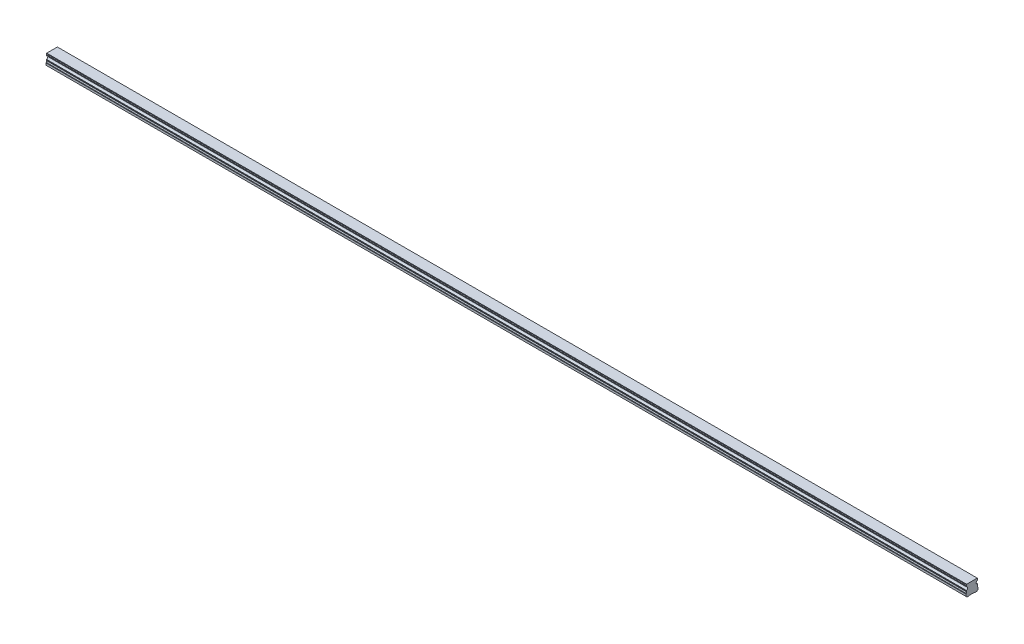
ISO-10303-21;
HEADER;
FILE_DESCRIPTION(('STEP AP214'),'2;1');
FILE_NAME('part.step','',(''),(''),'','','');
FILE_SCHEMA(('AUTOMOTIVE_DESIGN { 1 0 10303 214 1 1 1 1 }'));
ENDSEC;
DATA;
#1=APPLICATION_CONTEXT('core data for automotive mechanical design processes');
#2=APPLICATION_PROTOCOL_DEFINITION('international standard','automotive_design',2000,#1);
#3=PRODUCT_CONTEXT('',#1,'mechanical');
#4=PRODUCT('Part','Part','',(#3));
#5=PRODUCT_RELATED_PRODUCT_CATEGORY('part','',(#4));
#6=PRODUCT_DEFINITION_FORMATION('','',#4);
#7=PRODUCT_DEFINITION_CONTEXT('part definition',#1,'design');
#8=PRODUCT_DEFINITION('design','',#6,#7);
#9=PRODUCT_DEFINITION_SHAPE('','',#8);
#10=(LENGTH_UNIT() NAMED_UNIT(*) SI_UNIT(.MILLI.,.METRE.));
#11=(NAMED_UNIT(*) PLANE_ANGLE_UNIT() SI_UNIT($,.RADIAN.));
#12=(NAMED_UNIT(*) SI_UNIT($,.STERADIAN.) SOLID_ANGLE_UNIT());
#13=UNCERTAINTY_MEASURE_WITH_UNIT(LENGTH_MEASURE(1.E-05),#10,'distance_accuracy_value','');
#14=(GEOMETRIC_REPRESENTATION_CONTEXT(3) GLOBAL_UNCERTAINTY_ASSIGNED_CONTEXT((#13)) GLOBAL_UNIT_ASSIGNED_CONTEXT((#10,
#11,#12)) REPRESENTATION_CONTEXT('',''));
#15=CARTESIAN_POINT('',(0.,0.,0.));
#16=DIRECTION('',(0.,0.,1.));
#17=DIRECTION('',(1.,0.,0.));
#18=AXIS2_PLACEMENT_3D('',#15,#16,#17);
#19=CARTESIAN_POINT('',(1110.,0.399999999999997,0.));
#20=DIRECTION('',(0.,-1.,0.));
#21=DIRECTION('',(0.,0.,-1.));
#22=AXIS2_PLACEMENT_3D('',#19,#20,#21);
#23=CONICAL_SURFACE('',#22,2.90000000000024,0.785398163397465);
#24=CARTESIAN_POINT('',(1110.,0.80000000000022,0.));
#25=DIRECTION('',(0.,1.,0.));
#26=DIRECTION('',(0.,0.,1.));
#27=AXIS2_PLACEMENT_3D('',#24,#25,#26);
#28=CIRCLE('',#27,2.5);
#29=CARTESIAN_POINT('',(1110.,0.800000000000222,2.5));
#30=VERTEX_POINT('',#29);
#31=EDGE_CURVE('E11',#30,#30,#28,.F.);
#32=ORIENTED_EDGE('',*,*,#31,.F.);
#33=EDGE_LOOP('',(#32));
#34=FACE_BOUND('',#33,.T.);
#35=CARTESIAN_POINT('',(1110.,0.399999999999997,0.));
#36=DIRECTION('',(0.,1.,0.));
#37=DIRECTION('',(0.,0.,1.));
#38=AXIS2_PLACEMENT_3D('',#35,#36,#37);
#39=CIRCLE('',#38,2.90000000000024);
#40=CARTESIAN_POINT('',(1110.,0.399999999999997,2.90000000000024));
#41=VERTEX_POINT('',#40);
#42=EDGE_CURVE('E624',#41,#41,#39,.T.);
#43=ORIENTED_EDGE('',*,*,#42,.F.);
#44=EDGE_LOOP('',(#43));
#45=FACE_BOUND('',#44,.T.);
#46=ADVANCED_FACE('F39',(#34,#45),#23,.F.);
#47=CARTESIAN_POINT('',(1110.,7.,0.));
#48=DIRECTION('',(0.,-1.,0.));
#49=DIRECTION('',(0.,0.,-1.));
#50=AXIS2_PLACEMENT_3D('',#47,#48,#49);
#51=CYLINDRICAL_SURFACE('',#50,2.5);
#52=ORIENTED_EDGE('',*,*,#31,.T.);
#53=EDGE_LOOP('',(#52));
#54=FACE_BOUND('',#53,.T.);
#55=CARTESIAN_POINT('',(1110.,7.,0.));
#56=DIRECTION('',(0.,-1.,0.));
#57=DIRECTION('',(0.,0.,-1.));
#58=AXIS2_PLACEMENT_3D('',#55,#56,#57);
#59=CIRCLE('',#58,2.5);
#60=CARTESIAN_POINT('',(1110.,7.,-2.50000000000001));
#61=VERTEX_POINT('',#60);
#62=EDGE_CURVE('E49',#61,#61,#59,.T.);
#63=ORIENTED_EDGE('',*,*,#62,.F.);
#64=EDGE_LOOP('',(#63));
#65=FACE_BOUND('',#64,.T.);
#66=ADVANCED_FACE('F886',(#54,#65),#51,.F.);
#67=CARTESIAN_POINT('',(1110.,7.,0.));
#68=DIRECTION('',(0.,-1.,0.));
#69=DIRECTION('',(0.,0.,-1.));
#70=AXIS2_PLACEMENT_3D('',#67,#68,#69);
#71=PLANE('',#70);
#72=CARTESIAN_POINT('',(1110.,7.,0.));
#73=DIRECTION('',(0.,-1.,0.));
#74=DIRECTION('',(0.,0.,-1.));
#75=AXIS2_PLACEMENT_3D('',#72,#73,#74);
#76=CIRCLE('',#75,2.1);
#77=CARTESIAN_POINT('',(1110.,7.,-2.1));
#78=VERTEX_POINT('',#77);
#79=EDGE_CURVE('E42',#78,#78,#76,.T.);
#80=ORIENTED_EDGE('',*,*,#79,.F.);
#81=EDGE_LOOP('',(#80));
#82=FACE_BOUND('',#81,.T.);
#83=ORIENTED_EDGE('',*,*,#62,.T.);
#84=EDGE_LOOP('',(#83));
#85=FACE_BOUND('',#84,.T.);
#86=ADVANCED_FACE('F891',(#82,#85),#71,.T.);
#87=CARTESIAN_POINT('',(1050.,0.399999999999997,0.));
#88=DIRECTION('',(0.,-1.,0.));
#89=DIRECTION('',(0.,0.,-1.));
#90=AXIS2_PLACEMENT_3D('',#87,#88,#89);
#91=CONICAL_SURFACE('',#90,2.90000000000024,0.785398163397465);
#92=CARTESIAN_POINT('',(1050.,0.80000000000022,0.));
#93=DIRECTION('',(0.,1.,0.));
#94=DIRECTION('',(0.,0.,1.));
#95=AXIS2_PLACEMENT_3D('',#92,#93,#94);
#96=CIRCLE('',#95,2.5);
#97=CARTESIAN_POINT('',(1050.,0.800000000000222,2.5));
#98=VERTEX_POINT('',#97);
#99=EDGE_CURVE('E620',#98,#98,#96,.F.);
#100=ORIENTED_EDGE('',*,*,#99,.F.);
#101=EDGE_LOOP('',(#100));
#102=FACE_BOUND('',#101,.T.);
#103=CARTESIAN_POINT('',(1050.,0.399999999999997,0.));
#104=DIRECTION('',(0.,1.,0.));
#105=DIRECTION('',(0.,0.,1.));
#106=AXIS2_PLACEMENT_3D('',#103,#104,#105);
#107=CIRCLE('',#106,2.90000000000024);
#108=CARTESIAN_POINT('',(1050.,0.399999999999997,2.90000000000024));
#109=VERTEX_POINT('',#108);
#110=EDGE_CURVE('E612',#109,#109,#107,.T.);
#111=ORIENTED_EDGE('',*,*,#110,.F.);
#112=EDGE_LOOP('',(#111));
#113=FACE_BOUND('',#112,.T.);
#114=ADVANCED_FACE('F1158',(#102,#113),#91,.F.);
#115=CARTESIAN_POINT('',(1050.,7.,0.));
#116=DIRECTION('',(0.,-1.,0.));
#117=DIRECTION('',(0.,0.,-1.));
#118=AXIS2_PLACEMENT_3D('',#115,#116,#117);
#119=CYLINDRICAL_SURFACE('',#118,2.5);
#120=ORIENTED_EDGE('',*,*,#99,.T.);
#121=EDGE_LOOP('',(#120));
#122=FACE_BOUND('',#121,.T.);
#123=CARTESIAN_POINT('',(1050.,7.,0.));
#124=DIRECTION('',(0.,-1.,0.));
#125=DIRECTION('',(0.,0.,-1.));
#126=AXIS2_PLACEMENT_3D('',#123,#124,#125);
#127=CIRCLE('',#126,2.5);
#128=CARTESIAN_POINT('',(1050.,7.,-2.50000000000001));
#129=VERTEX_POINT('',#128);
#130=EDGE_CURVE('E616',#129,#129,#127,.T.);
#131=ORIENTED_EDGE('',*,*,#130,.F.);
#132=EDGE_LOOP('',(#131));
#133=FACE_BOUND('',#132,.T.);
#134=ADVANCED_FACE('F1154',(#122,#133),#119,.F.);
#135=CARTESIAN_POINT('',(1050.,7.,0.));
#136=DIRECTION('',(0.,-1.,0.));
#137=DIRECTION('',(0.,0.,-1.));
#138=AXIS2_PLACEMENT_3D('',#135,#136,#137);
#139=PLANE('',#138);
#140=CARTESIAN_POINT('',(1050.,7.,0.));
#141=DIRECTION('',(0.,-1.,0.));
#142=DIRECTION('',(0.,0.,-1.));
#143=AXIS2_PLACEMENT_3D('',#140,#141,#142);
#144=CIRCLE('',#143,2.1);
#145=CARTESIAN_POINT('',(1050.,7.,-2.1));
#146=VERTEX_POINT('',#145);
#147=EDGE_CURVE('E695',#146,#146,#144,.T.);
#148=ORIENTED_EDGE('',*,*,#147,.F.);
#149=EDGE_LOOP('',(#148));
#150=FACE_BOUND('',#149,.T.);
#151=ORIENTED_EDGE('',*,*,#130,.T.);
#152=EDGE_LOOP('',(#151));
#153=FACE_BOUND('',#152,.T.);
#154=ADVANCED_FACE('F1150',(#150,#153),#139,.T.);
#155=CARTESIAN_POINT('',(990.,0.399999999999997,0.));
#156=DIRECTION('',(0.,-1.,0.));
#157=DIRECTION('',(0.,0.,-1.));
#158=AXIS2_PLACEMENT_3D('',#155,#156,#157);
#159=CONICAL_SURFACE('',#158,2.90000000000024,0.785398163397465);
#160=CARTESIAN_POINT('',(990.,0.80000000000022,0.));
#161=DIRECTION('',(0.,1.,0.));
#162=DIRECTION('',(0.,0.,1.));
#163=AXIS2_PLACEMENT_3D('',#160,#161,#162);
#164=CIRCLE('',#163,2.5);
#165=CARTESIAN_POINT('',(990.,0.800000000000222,2.5));
#166=VERTEX_POINT('',#165);
#167=EDGE_CURVE('E608',#166,#166,#164,.F.);
#168=ORIENTED_EDGE('',*,*,#167,.F.);
#169=EDGE_LOOP('',(#168));
#170=FACE_BOUND('',#169,.T.);
#171=CARTESIAN_POINT('',(990.,0.399999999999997,0.));
#172=DIRECTION('',(0.,1.,0.));
#173=DIRECTION('',(0.,0.,1.));
#174=AXIS2_PLACEMENT_3D('',#171,#172,#173);
#175=CIRCLE('',#174,2.90000000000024);
#176=CARTESIAN_POINT('',(990.,0.399999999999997,2.90000000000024));
#177=VERTEX_POINT('',#176);
#178=EDGE_CURVE('E600',#177,#177,#175,.T.);
#179=ORIENTED_EDGE('',*,*,#178,.F.);
#180=EDGE_LOOP('',(#179));
#181=FACE_BOUND('',#180,.T.);
#182=ADVANCED_FACE('F1146',(#170,#181),#159,.F.);
#183=CARTESIAN_POINT('',(990.,7.,0.));
#184=DIRECTION('',(0.,-1.,0.));
#185=DIRECTION('',(0.,0.,-1.));
#186=AXIS2_PLACEMENT_3D('',#183,#184,#185);
#187=CYLINDRICAL_SURFACE('',#186,2.5);
#188=ORIENTED_EDGE('',*,*,#167,.T.);
#189=EDGE_LOOP('',(#188));
#190=FACE_BOUND('',#189,.T.);
#191=CARTESIAN_POINT('',(990.,7.,0.));
#192=DIRECTION('',(0.,-1.,0.));
#193=DIRECTION('',(0.,0.,-1.));
#194=AXIS2_PLACEMENT_3D('',#191,#192,#193);
#195=CIRCLE('',#194,2.5);
#196=CARTESIAN_POINT('',(990.,7.,-2.50000000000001));
#197=VERTEX_POINT('',#196);
#198=EDGE_CURVE('E604',#197,#197,#195,.T.);
#199=ORIENTED_EDGE('',*,*,#198,.F.);
#200=EDGE_LOOP('',(#199));
#201=FACE_BOUND('',#200,.T.);
#202=ADVANCED_FACE('F1142',(#190,#201),#187,.F.);
#203=CARTESIAN_POINT('',(990.,7.,0.));
#204=DIRECTION('',(0.,-1.,0.));
#205=DIRECTION('',(0.,0.,-1.));
#206=AXIS2_PLACEMENT_3D('',#203,#204,#205);
#207=PLANE('',#206);
#208=CARTESIAN_POINT('',(990.,7.,0.));
#209=DIRECTION('',(0.,-1.,0.));
#210=DIRECTION('',(0.,0.,-1.));
#211=AXIS2_PLACEMENT_3D('',#208,#209,#210);
#212=CIRCLE('',#211,2.1);
#213=CARTESIAN_POINT('',(990.,7.,-2.1));
#214=VERTEX_POINT('',#213);
#215=EDGE_CURVE('E692',#214,#214,#212,.T.);
#216=ORIENTED_EDGE('',*,*,#215,.F.);
#217=EDGE_LOOP('',(#216));
#218=FACE_BOUND('',#217,.T.);
#219=ORIENTED_EDGE('',*,*,#198,.T.);
#220=EDGE_LOOP('',(#219));
#221=FACE_BOUND('',#220,.T.);
#222=ADVANCED_FACE('F1138',(#218,#221),#207,.T.);
#223=CARTESIAN_POINT('',(930.,0.399999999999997,0.));
#224=DIRECTION('',(0.,-1.,0.));
#225=DIRECTION('',(0.,0.,-1.));
#226=AXIS2_PLACEMENT_3D('',#223,#224,#225);
#227=CONICAL_SURFACE('',#226,2.90000000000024,0.785398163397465);
#228=CARTESIAN_POINT('',(930.,0.80000000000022,0.));
#229=DIRECTION('',(0.,1.,0.));
#230=DIRECTION('',(0.,0.,1.));
#231=AXIS2_PLACEMENT_3D('',#228,#229,#230);
#232=CIRCLE('',#231,2.5);
#233=CARTESIAN_POINT('',(930.,0.800000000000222,2.5));
#234=VERTEX_POINT('',#233);
#235=EDGE_CURVE('E596',#234,#234,#232,.F.);
#236=ORIENTED_EDGE('',*,*,#235,.F.);
#237=EDGE_LOOP('',(#236));
#238=FACE_BOUND('',#237,.T.);
#239=CARTESIAN_POINT('',(930.,0.399999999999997,0.));
#240=DIRECTION('',(0.,1.,0.));
#241=DIRECTION('',(0.,0.,1.));
#242=AXIS2_PLACEMENT_3D('',#239,#240,#241);
#243=CIRCLE('',#242,2.90000000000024);
#244=CARTESIAN_POINT('',(930.,0.399999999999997,2.90000000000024));
#245=VERTEX_POINT('',#244);
#246=EDGE_CURVE('E588',#245,#245,#243,.T.);
#247=ORIENTED_EDGE('',*,*,#246,.F.);
#248=EDGE_LOOP('',(#247));
#249=FACE_BOUND('',#248,.T.);
#250=ADVANCED_FACE('F1134',(#238,#249),#227,.F.);
#251=CARTESIAN_POINT('',(930.,7.,0.));
#252=DIRECTION('',(0.,-1.,0.));
#253=DIRECTION('',(0.,0.,-1.));
#254=AXIS2_PLACEMENT_3D('',#251,#252,#253);
#255=CYLINDRICAL_SURFACE('',#254,2.5);
#256=ORIENTED_EDGE('',*,*,#235,.T.);
#257=EDGE_LOOP('',(#256));
#258=FACE_BOUND('',#257,.T.);
#259=CARTESIAN_POINT('',(930.,7.,0.));
#260=DIRECTION('',(0.,-1.,0.));
#261=DIRECTION('',(0.,0.,-1.));
#262=AXIS2_PLACEMENT_3D('',#259,#260,#261);
#263=CIRCLE('',#262,2.5);
#264=CARTESIAN_POINT('',(930.,7.,-2.50000000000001));
#265=VERTEX_POINT('',#264);
#266=EDGE_CURVE('E592',#265,#265,#263,.T.);
#267=ORIENTED_EDGE('',*,*,#266,.F.);
#268=EDGE_LOOP('',(#267));
#269=FACE_BOUND('',#268,.T.);
#270=ADVANCED_FACE('F1130',(#258,#269),#255,.F.);
#271=CARTESIAN_POINT('',(930.,7.,0.));
#272=DIRECTION('',(0.,-1.,0.));
#273=DIRECTION('',(0.,0.,-1.));
#274=AXIS2_PLACEMENT_3D('',#271,#272,#273);
#275=PLANE('',#274);
#276=CARTESIAN_POINT('',(930.,7.,0.));
#277=DIRECTION('',(0.,-1.,0.));
#278=DIRECTION('',(0.,0.,-1.));
#279=AXIS2_PLACEMENT_3D('',#276,#277,#278);
#280=CIRCLE('',#279,2.1);
#281=CARTESIAN_POINT('',(930.,7.,-2.1));
#282=VERTEX_POINT('',#281);
#283=EDGE_CURVE('E688',#282,#282,#280,.T.);
#284=ORIENTED_EDGE('',*,*,#283,.F.);
#285=EDGE_LOOP('',(#284));
#286=FACE_BOUND('',#285,.T.);
#287=ORIENTED_EDGE('',*,*,#266,.T.);
#288=EDGE_LOOP('',(#287));
#289=FACE_BOUND('',#288,.T.);
#290=ADVANCED_FACE('F1126',(#286,#289),#275,.T.);
#291=CARTESIAN_POINT('',(870.,0.399999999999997,0.));
#292=DIRECTION('',(0.,-1.,0.));
#293=DIRECTION('',(0.,0.,-1.));
#294=AXIS2_PLACEMENT_3D('',#291,#292,#293);
#295=CONICAL_SURFACE('',#294,2.90000000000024,0.785398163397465);
#296=CARTESIAN_POINT('',(870.,0.80000000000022,0.));
#297=DIRECTION('',(0.,1.,0.));
#298=DIRECTION('',(0.,0.,1.));
#299=AXIS2_PLACEMENT_3D('',#296,#297,#298);
#300=CIRCLE('',#299,2.5);
#301=CARTESIAN_POINT('',(870.,0.800000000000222,2.5));
#302=VERTEX_POINT('',#301);
#303=EDGE_CURVE('E584',#302,#302,#300,.F.);
#304=ORIENTED_EDGE('',*,*,#303,.F.);
#305=EDGE_LOOP('',(#304));
#306=FACE_BOUND('',#305,.T.);
#307=CARTESIAN_POINT('',(870.,0.399999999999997,0.));
#308=DIRECTION('',(0.,1.,0.));
#309=DIRECTION('',(0.,0.,1.));
#310=AXIS2_PLACEMENT_3D('',#307,#308,#309);
#311=CIRCLE('',#310,2.90000000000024);
#312=CARTESIAN_POINT('',(870.,0.399999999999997,2.90000000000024));
#313=VERTEX_POINT('',#312);
#314=EDGE_CURVE('E576',#313,#313,#311,.T.);
#315=ORIENTED_EDGE('',*,*,#314,.F.);
#316=EDGE_LOOP('',(#315));
#317=FACE_BOUND('',#316,.T.);
#318=ADVANCED_FACE('F1122',(#306,#317),#295,.F.);
#319=CARTESIAN_POINT('',(870.,7.,0.));
#320=DIRECTION('',(0.,-1.,0.));
#321=DIRECTION('',(0.,0.,-1.));
#322=AXIS2_PLACEMENT_3D('',#319,#320,#321);
#323=CYLINDRICAL_SURFACE('',#322,2.5);
#324=ORIENTED_EDGE('',*,*,#303,.T.);
#325=EDGE_LOOP('',(#324));
#326=FACE_BOUND('',#325,.T.);
#327=CARTESIAN_POINT('',(870.,7.,0.));
#328=DIRECTION('',(0.,-1.,0.));
#329=DIRECTION('',(0.,0.,-1.));
#330=AXIS2_PLACEMENT_3D('',#327,#328,#329);
#331=CIRCLE('',#330,2.5);
#332=CARTESIAN_POINT('',(870.,7.,-2.50000000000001));
#333=VERTEX_POINT('',#332);
#334=EDGE_CURVE('E580',#333,#333,#331,.T.);
#335=ORIENTED_EDGE('',*,*,#334,.F.);
#336=EDGE_LOOP('',(#335));
#337=FACE_BOUND('',#336,.T.);
#338=ADVANCED_FACE('F1118',(#326,#337),#323,.F.);
#339=CARTESIAN_POINT('',(870.,7.,0.));
#340=DIRECTION('',(0.,-1.,0.));
#341=DIRECTION('',(0.,0.,-1.));
#342=AXIS2_PLACEMENT_3D('',#339,#340,#341);
#343=PLANE('',#342);
#344=CARTESIAN_POINT('',(870.,7.,0.));
#345=DIRECTION('',(0.,-1.,0.));
#346=DIRECTION('',(0.,0.,-1.));
#347=AXIS2_PLACEMENT_3D('',#344,#345,#346);
#348=CIRCLE('',#347,2.1);
#349=CARTESIAN_POINT('',(870.,7.,-2.1));
#350=VERTEX_POINT('',#349);
#351=EDGE_CURVE('E684',#350,#350,#348,.T.);
#352=ORIENTED_EDGE('',*,*,#351,.F.);
#353=EDGE_LOOP('',(#352));
#354=FACE_BOUND('',#353,.T.);
#355=ORIENTED_EDGE('',*,*,#334,.T.);
#356=EDGE_LOOP('',(#355));
#357=FACE_BOUND('',#356,.T.);
#358=ADVANCED_FACE('F1114',(#354,#357),#343,.T.);
#359=CARTESIAN_POINT('',(810.,0.399999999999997,0.));
#360=DIRECTION('',(0.,-1.,0.));
#361=DIRECTION('',(0.,0.,-1.));
#362=AXIS2_PLACEMENT_3D('',#359,#360,#361);
#363=CONICAL_SURFACE('',#362,2.90000000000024,0.785398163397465);
#364=CARTESIAN_POINT('',(810.,0.80000000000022,0.));
#365=DIRECTION('',(0.,1.,0.));
#366=DIRECTION('',(0.,0.,1.));
#367=AXIS2_PLACEMENT_3D('',#364,#365,#366);
#368=CIRCLE('',#367,2.5);
#369=CARTESIAN_POINT('',(810.,0.800000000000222,2.5));
#370=VERTEX_POINT('',#369);
#371=EDGE_CURVE('E572',#370,#370,#368,.F.);
#372=ORIENTED_EDGE('',*,*,#371,.F.);
#373=EDGE_LOOP('',(#372));
#374=FACE_BOUND('',#373,.T.);
#375=CARTESIAN_POINT('',(810.,0.399999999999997,0.));
#376=DIRECTION('',(0.,1.,0.));
#377=DIRECTION('',(0.,0.,1.));
#378=AXIS2_PLACEMENT_3D('',#375,#376,#377);
#379=CIRCLE('',#378,2.90000000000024);
#380=CARTESIAN_POINT('',(810.,0.399999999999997,2.90000000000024));
#381=VERTEX_POINT('',#380);
#382=EDGE_CURVE('E564',#381,#381,#379,.T.);
#383=ORIENTED_EDGE('',*,*,#382,.F.);
#384=EDGE_LOOP('',(#383));
#385=FACE_BOUND('',#384,.T.);
#386=ADVANCED_FACE('F1110',(#374,#385),#363,.F.);
#387=CARTESIAN_POINT('',(810.,7.,0.));
#388=DIRECTION('',(0.,-1.,0.));
#389=DIRECTION('',(0.,0.,-1.));
#390=AXIS2_PLACEMENT_3D('',#387,#388,#389);
#391=CYLINDRICAL_SURFACE('',#390,2.5);
#392=ORIENTED_EDGE('',*,*,#371,.T.);
#393=EDGE_LOOP('',(#392));
#394=FACE_BOUND('',#393,.T.);
#395=CARTESIAN_POINT('',(810.,7.,0.));
#396=DIRECTION('',(0.,-1.,0.));
#397=DIRECTION('',(0.,0.,-1.));
#398=AXIS2_PLACEMENT_3D('',#395,#396,#397);
#399=CIRCLE('',#398,2.5);
#400=CARTESIAN_POINT('',(810.,7.,-2.50000000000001));
#401=VERTEX_POINT('',#400);
#402=EDGE_CURVE('E568',#401,#401,#399,.T.);
#403=ORIENTED_EDGE('',*,*,#402,.F.);
#404=EDGE_LOOP('',(#403));
#405=FACE_BOUND('',#404,.T.);
#406=ADVANCED_FACE('F1106',(#394,#405),#391,.F.);
#407=CARTESIAN_POINT('',(810.,7.,0.));
#408=DIRECTION('',(0.,-1.,0.));
#409=DIRECTION('',(0.,0.,-1.));
#410=AXIS2_PLACEMENT_3D('',#407,#408,#409);
#411=PLANE('',#410);
#412=CARTESIAN_POINT('',(810.,7.,0.));
#413=DIRECTION('',(0.,-1.,0.));
#414=DIRECTION('',(0.,0.,-1.));
#415=AXIS2_PLACEMENT_3D('',#412,#413,#414);
#416=CIRCLE('',#415,2.1);
#417=CARTESIAN_POINT('',(810.,7.,-2.1));
#418=VERTEX_POINT('',#417);
#419=EDGE_CURVE('E680',#418,#418,#416,.T.);
#420=ORIENTED_EDGE('',*,*,#419,.F.);
#421=EDGE_LOOP('',(#420));
#422=FACE_BOUND('',#421,.T.);
#423=ORIENTED_EDGE('',*,*,#402,.T.);
#424=EDGE_LOOP('',(#423));
#425=FACE_BOUND('',#424,.T.);
#426=ADVANCED_FACE('F1102',(#422,#425),#411,.T.);
#427=CARTESIAN_POINT('',(750.,0.399999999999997,0.));
#428=DIRECTION('',(0.,-1.,0.));
#429=DIRECTION('',(0.,0.,-1.));
#430=AXIS2_PLACEMENT_3D('',#427,#428,#429);
#431=CONICAL_SURFACE('',#430,2.90000000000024,0.785398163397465);
#432=CARTESIAN_POINT('',(750.,0.80000000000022,0.));
#433=DIRECTION('',(0.,1.,0.));
#434=DIRECTION('',(0.,0.,1.));
#435=AXIS2_PLACEMENT_3D('',#432,#433,#434);
#436=CIRCLE('',#435,2.5);
#437=CARTESIAN_POINT('',(750.,0.800000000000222,2.5));
#438=VERTEX_POINT('',#437);
#439=EDGE_CURVE('E560',#438,#438,#436,.F.);
#440=ORIENTED_EDGE('',*,*,#439,.F.);
#441=EDGE_LOOP('',(#440));
#442=FACE_BOUND('',#441,.T.);
#443=CARTESIAN_POINT('',(750.,0.399999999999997,0.));
#444=DIRECTION('',(0.,1.,0.));
#445=DIRECTION('',(0.,0.,1.));
#446=AXIS2_PLACEMENT_3D('',#443,#444,#445);
#447=CIRCLE('',#446,2.90000000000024);
#448=CARTESIAN_POINT('',(750.,0.399999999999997,2.90000000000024));
#449=VERTEX_POINT('',#448);
#450=EDGE_CURVE('E552',#449,#449,#447,.T.);
#451=ORIENTED_EDGE('',*,*,#450,.F.);
#452=EDGE_LOOP('',(#451));
#453=FACE_BOUND('',#452,.T.);
#454=ADVANCED_FACE('F1098',(#442,#453),#431,.F.);
#455=CARTESIAN_POINT('',(750.,7.,0.));
#456=DIRECTION('',(0.,-1.,0.));
#457=DIRECTION('',(0.,0.,-1.));
#458=AXIS2_PLACEMENT_3D('',#455,#456,#457);
#459=CYLINDRICAL_SURFACE('',#458,2.5);
#460=ORIENTED_EDGE('',*,*,#439,.T.);
#461=EDGE_LOOP('',(#460));
#462=FACE_BOUND('',#461,.T.);
#463=CARTESIAN_POINT('',(750.,7.,0.));
#464=DIRECTION('',(0.,-1.,0.));
#465=DIRECTION('',(0.,0.,-1.));
#466=AXIS2_PLACEMENT_3D('',#463,#464,#465);
#467=CIRCLE('',#466,2.5);
#468=CARTESIAN_POINT('',(750.,7.,-2.50000000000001));
#469=VERTEX_POINT('',#468);
#470=EDGE_CURVE('E556',#469,#469,#467,.T.);
#471=ORIENTED_EDGE('',*,*,#470,.F.);
#472=EDGE_LOOP('',(#471));
#473=FACE_BOUND('',#472,.T.);
#474=ADVANCED_FACE('F1094',(#462,#473),#459,.F.);
#475=CARTESIAN_POINT('',(750.,7.,0.));
#476=DIRECTION('',(0.,-1.,0.));
#477=DIRECTION('',(0.,0.,-1.));
#478=AXIS2_PLACEMENT_3D('',#475,#476,#477);
#479=PLANE('',#478);
#480=CARTESIAN_POINT('',(750.,7.,0.));
#481=DIRECTION('',(0.,-1.,0.));
#482=DIRECTION('',(0.,0.,-1.));
#483=AXIS2_PLACEMENT_3D('',#480,#481,#482);
#484=CIRCLE('',#483,2.1);
#485=CARTESIAN_POINT('',(750.,7.,-2.1));
#486=VERTEX_POINT('',#485);
#487=EDGE_CURVE('E676',#486,#486,#484,.T.);
#488=ORIENTED_EDGE('',*,*,#487,.F.);
#489=EDGE_LOOP('',(#488));
#490=FACE_BOUND('',#489,.T.);
#491=ORIENTED_EDGE('',*,*,#470,.T.);
#492=EDGE_LOOP('',(#491));
#493=FACE_BOUND('',#492,.T.);
#494=ADVANCED_FACE('F1090',(#490,#493),#479,.T.);
#495=CARTESIAN_POINT('',(690.,0.399999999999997,0.));
#496=DIRECTION('',(0.,-1.,0.));
#497=DIRECTION('',(0.,0.,-1.));
#498=AXIS2_PLACEMENT_3D('',#495,#496,#497);
#499=CONICAL_SURFACE('',#498,2.90000000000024,0.785398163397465);
#500=CARTESIAN_POINT('',(690.,0.80000000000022,0.));
#501=DIRECTION('',(0.,1.,0.));
#502=DIRECTION('',(0.,0.,1.));
#503=AXIS2_PLACEMENT_3D('',#500,#501,#502);
#504=CIRCLE('',#503,2.5);
#505=CARTESIAN_POINT('',(690.,0.800000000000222,2.5));
#506=VERTEX_POINT('',#505);
#507=EDGE_CURVE('E548',#506,#506,#504,.F.);
#508=ORIENTED_EDGE('',*,*,#507,.F.);
#509=EDGE_LOOP('',(#508));
#510=FACE_BOUND('',#509,.T.);
#511=CARTESIAN_POINT('',(690.,0.399999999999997,0.));
#512=DIRECTION('',(0.,1.,0.));
#513=DIRECTION('',(0.,0.,1.));
#514=AXIS2_PLACEMENT_3D('',#511,#512,#513);
#515=CIRCLE('',#514,2.90000000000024);
#516=CARTESIAN_POINT('',(690.,0.399999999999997,2.90000000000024));
#517=VERTEX_POINT('',#516);
#518=EDGE_CURVE('E540',#517,#517,#515,.T.);
#519=ORIENTED_EDGE('',*,*,#518,.F.);
#520=EDGE_LOOP('',(#519));
#521=FACE_BOUND('',#520,.T.);
#522=ADVANCED_FACE('F1086',(#510,#521),#499,.F.);
#523=CARTESIAN_POINT('',(690.,7.,0.));
#524=DIRECTION('',(0.,-1.,0.));
#525=DIRECTION('',(0.,0.,-1.));
#526=AXIS2_PLACEMENT_3D('',#523,#524,#525);
#527=CYLINDRICAL_SURFACE('',#526,2.5);
#528=ORIENTED_EDGE('',*,*,#507,.T.);
#529=EDGE_LOOP('',(#528));
#530=FACE_BOUND('',#529,.T.);
#531=CARTESIAN_POINT('',(690.,7.,0.));
#532=DIRECTION('',(0.,-1.,0.));
#533=DIRECTION('',(0.,0.,-1.));
#534=AXIS2_PLACEMENT_3D('',#531,#532,#533);
#535=CIRCLE('',#534,2.5);
#536=CARTESIAN_POINT('',(690.,7.,-2.50000000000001));
#537=VERTEX_POINT('',#536);
#538=EDGE_CURVE('E544',#537,#537,#535,.T.);
#539=ORIENTED_EDGE('',*,*,#538,.F.);
#540=EDGE_LOOP('',(#539));
#541=FACE_BOUND('',#540,.T.);
#542=ADVANCED_FACE('F1082',(#530,#541),#527,.F.);
#543=CARTESIAN_POINT('',(690.,7.,0.));
#544=DIRECTION('',(0.,-1.,0.));
#545=DIRECTION('',(0.,0.,-1.));
#546=AXIS2_PLACEMENT_3D('',#543,#544,#545);
#547=PLANE('',#546);
#548=CARTESIAN_POINT('',(690.,7.,0.));
#549=DIRECTION('',(0.,-1.,0.));
#550=DIRECTION('',(0.,0.,-1.));
#551=AXIS2_PLACEMENT_3D('',#548,#549,#550);
#552=CIRCLE('',#551,2.1);
#553=CARTESIAN_POINT('',(690.,7.,-2.1));
#554=VERTEX_POINT('',#553);
#555=EDGE_CURVE('E672',#554,#554,#552,.T.);
#556=ORIENTED_EDGE('',*,*,#555,.F.);
#557=EDGE_LOOP('',(#556));
#558=FACE_BOUND('',#557,.T.);
#559=ORIENTED_EDGE('',*,*,#538,.T.);
#560=EDGE_LOOP('',(#559));
#561=FACE_BOUND('',#560,.T.);
#562=ADVANCED_FACE('F1078',(#558,#561),#547,.T.);
#563=CARTESIAN_POINT('',(630.,0.399999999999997,0.));
#564=DIRECTION('',(0.,-1.,0.));
#565=DIRECTION('',(0.,0.,-1.));
#566=AXIS2_PLACEMENT_3D('',#563,#564,#565);
#567=CONICAL_SURFACE('',#566,2.90000000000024,0.785398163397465);
#568=CARTESIAN_POINT('',(630.,0.80000000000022,0.));
#569=DIRECTION('',(0.,1.,0.));
#570=DIRECTION('',(0.,0.,1.));
#571=AXIS2_PLACEMENT_3D('',#568,#569,#570);
#572=CIRCLE('',#571,2.5);
#573=CARTESIAN_POINT('',(630.,0.800000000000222,2.5));
#574=VERTEX_POINT('',#573);
#575=EDGE_CURVE('E536',#574,#574,#572,.F.);
#576=ORIENTED_EDGE('',*,*,#575,.F.);
#577=EDGE_LOOP('',(#576));
#578=FACE_BOUND('',#577,.T.);
#579=CARTESIAN_POINT('',(630.,0.399999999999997,0.));
#580=DIRECTION('',(0.,1.,0.));
#581=DIRECTION('',(0.,0.,1.));
#582=AXIS2_PLACEMENT_3D('',#579,#580,#581);
#583=CIRCLE('',#582,2.90000000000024);
#584=CARTESIAN_POINT('',(630.,0.399999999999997,2.90000000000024));
#585=VERTEX_POINT('',#584);
#586=EDGE_CURVE('E528',#585,#585,#583,.T.);
#587=ORIENTED_EDGE('',*,*,#586,.F.);
#588=EDGE_LOOP('',(#587));
#589=FACE_BOUND('',#588,.T.);
#590=ADVANCED_FACE('F1074',(#578,#589),#567,.F.);
#591=CARTESIAN_POINT('',(630.,7.,0.));
#592=DIRECTION('',(0.,-1.,0.));
#593=DIRECTION('',(0.,0.,-1.));
#594=AXIS2_PLACEMENT_3D('',#591,#592,#593);
#595=CYLINDRICAL_SURFACE('',#594,2.5);
#596=ORIENTED_EDGE('',*,*,#575,.T.);
#597=EDGE_LOOP('',(#596));
#598=FACE_BOUND('',#597,.T.);
#599=CARTESIAN_POINT('',(630.,7.,0.));
#600=DIRECTION('',(0.,-1.,0.));
#601=DIRECTION('',(0.,0.,-1.));
#602=AXIS2_PLACEMENT_3D('',#599,#600,#601);
#603=CIRCLE('',#602,2.5);
#604=CARTESIAN_POINT('',(630.,7.,-2.50000000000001));
#605=VERTEX_POINT('',#604);
#606=EDGE_CURVE('E532',#605,#605,#603,.T.);
#607=ORIENTED_EDGE('',*,*,#606,.F.);
#608=EDGE_LOOP('',(#607));
#609=FACE_BOUND('',#608,.T.);
#610=ADVANCED_FACE('F1070',(#598,#609),#595,.F.);
#611=CARTESIAN_POINT('',(630.,7.,0.));
#612=DIRECTION('',(0.,-1.,0.));
#613=DIRECTION('',(0.,0.,-1.));
#614=AXIS2_PLACEMENT_3D('',#611,#612,#613);
#615=PLANE('',#614);
#616=CARTESIAN_POINT('',(630.,7.,0.));
#617=DIRECTION('',(0.,-1.,0.));
#618=DIRECTION('',(0.,0.,-1.));
#619=AXIS2_PLACEMENT_3D('',#616,#617,#618);
#620=CIRCLE('',#619,2.1);
#621=CARTESIAN_POINT('',(630.,7.,-2.1));
#622=VERTEX_POINT('',#621);
#623=EDGE_CURVE('E668',#622,#622,#620,.T.);
#624=ORIENTED_EDGE('',*,*,#623,.F.);
#625=EDGE_LOOP('',(#624));
#626=FACE_BOUND('',#625,.T.);
#627=ORIENTED_EDGE('',*,*,#606,.T.);
#628=EDGE_LOOP('',(#627));
#629=FACE_BOUND('',#628,.T.);
#630=ADVANCED_FACE('F1066',(#626,#629),#615,.T.);
#631=CARTESIAN_POINT('',(570.,0.399999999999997,0.));
#632=DIRECTION('',(0.,-1.,0.));
#633=DIRECTION('',(0.,0.,-1.));
#634=AXIS2_PLACEMENT_3D('',#631,#632,#633);
#635=CONICAL_SURFACE('',#634,2.90000000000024,0.785398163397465);
#636=CARTESIAN_POINT('',(570.,0.80000000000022,0.));
#637=DIRECTION('',(0.,1.,0.));
#638=DIRECTION('',(0.,0.,1.));
#639=AXIS2_PLACEMENT_3D('',#636,#637,#638);
#640=CIRCLE('',#639,2.5);
#641=CARTESIAN_POINT('',(570.,0.800000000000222,2.5));
#642=VERTEX_POINT('',#641);
#643=EDGE_CURVE('E524',#642,#642,#640,.F.);
#644=ORIENTED_EDGE('',*,*,#643,.F.);
#645=EDGE_LOOP('',(#644));
#646=FACE_BOUND('',#645,.T.);
#647=CARTESIAN_POINT('',(570.,0.399999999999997,0.));
#648=DIRECTION('',(0.,1.,0.));
#649=DIRECTION('',(0.,0.,1.));
#650=AXIS2_PLACEMENT_3D('',#647,#648,#649);
#651=CIRCLE('',#650,2.90000000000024);
#652=CARTESIAN_POINT('',(570.,0.399999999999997,2.90000000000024));
#653=VERTEX_POINT('',#652);
#654=EDGE_CURVE('E516',#653,#653,#651,.T.);
#655=ORIENTED_EDGE('',*,*,#654,.F.);
#656=EDGE_LOOP('',(#655));
#657=FACE_BOUND('',#656,.T.);
#658=ADVANCED_FACE('F1062',(#646,#657),#635,.F.);
#659=CARTESIAN_POINT('',(570.,7.,0.));
#660=DIRECTION('',(0.,-1.,0.));
#661=DIRECTION('',(0.,0.,-1.));
#662=AXIS2_PLACEMENT_3D('',#659,#660,#661);
#663=CYLINDRICAL_SURFACE('',#662,2.5);
#664=ORIENTED_EDGE('',*,*,#643,.T.);
#665=EDGE_LOOP('',(#664));
#666=FACE_BOUND('',#665,.T.);
#667=CARTESIAN_POINT('',(570.,7.,0.));
#668=DIRECTION('',(0.,-1.,0.));
#669=DIRECTION('',(0.,0.,-1.));
#670=AXIS2_PLACEMENT_3D('',#667,#668,#669);
#671=CIRCLE('',#670,2.5);
#672=CARTESIAN_POINT('',(570.,7.,-2.50000000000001));
#673=VERTEX_POINT('',#672);
#674=EDGE_CURVE('E520',#673,#673,#671,.T.);
#675=ORIENTED_EDGE('',*,*,#674,.F.);
#676=EDGE_LOOP('',(#675));
#677=FACE_BOUND('',#676,.T.);
#678=ADVANCED_FACE('F1058',(#666,#677),#663,.F.);
#679=CARTESIAN_POINT('',(570.,7.,0.));
#680=DIRECTION('',(0.,-1.,0.));
#681=DIRECTION('',(0.,0.,-1.));
#682=AXIS2_PLACEMENT_3D('',#679,#680,#681);
#683=PLANE('',#682);
#684=CARTESIAN_POINT('',(570.,7.,0.));
#685=DIRECTION('',(0.,-1.,0.));
#686=DIRECTION('',(0.,0.,-1.));
#687=AXIS2_PLACEMENT_3D('',#684,#685,#686);
#688=CIRCLE('',#687,2.1);
#689=CARTESIAN_POINT('',(570.,7.,-2.1));
#690=VERTEX_POINT('',#689);
#691=EDGE_CURVE('E664',#690,#690,#688,.T.);
#692=ORIENTED_EDGE('',*,*,#691,.F.);
#693=EDGE_LOOP('',(#692));
#694=FACE_BOUND('',#693,.T.);
#695=ORIENTED_EDGE('',*,*,#674,.T.);
#696=EDGE_LOOP('',(#695));
#697=FACE_BOUND('',#696,.T.);
#698=ADVANCED_FACE('F1054',(#694,#697),#683,.T.);
#699=CARTESIAN_POINT('',(510.,0.399999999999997,0.));
#700=DIRECTION('',(0.,-1.,0.));
#701=DIRECTION('',(0.,0.,-1.));
#702=AXIS2_PLACEMENT_3D('',#699,#700,#701);
#703=CONICAL_SURFACE('',#702,2.90000000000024,0.785398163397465);
#704=CARTESIAN_POINT('',(510.,0.80000000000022,0.));
#705=DIRECTION('',(0.,1.,0.));
#706=DIRECTION('',(0.,0.,1.));
#707=AXIS2_PLACEMENT_3D('',#704,#705,#706);
#708=CIRCLE('',#707,2.5);
#709=CARTESIAN_POINT('',(510.,0.800000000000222,2.5));
#710=VERTEX_POINT('',#709);
#711=EDGE_CURVE('E512',#710,#710,#708,.F.);
#712=ORIENTED_EDGE('',*,*,#711,.F.);
#713=EDGE_LOOP('',(#712));
#714=FACE_BOUND('',#713,.T.);
#715=CARTESIAN_POINT('',(510.,0.399999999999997,0.));
#716=DIRECTION('',(0.,1.,0.));
#717=DIRECTION('',(0.,0.,1.));
#718=AXIS2_PLACEMENT_3D('',#715,#716,#717);
#719=CIRCLE('',#718,2.90000000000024);
#720=CARTESIAN_POINT('',(510.,0.399999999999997,2.90000000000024));
#721=VERTEX_POINT('',#720);
#722=EDGE_CURVE('E504',#721,#721,#719,.T.);
#723=ORIENTED_EDGE('',*,*,#722,.F.);
#724=EDGE_LOOP('',(#723));
#725=FACE_BOUND('',#724,.T.);
#726=ADVANCED_FACE('F1050',(#714,#725),#703,.F.);
#727=CARTESIAN_POINT('',(510.,7.,0.));
#728=DIRECTION('',(0.,-1.,0.));
#729=DIRECTION('',(0.,0.,-1.));
#730=AXIS2_PLACEMENT_3D('',#727,#728,#729);
#731=CYLINDRICAL_SURFACE('',#730,2.5);
#732=ORIENTED_EDGE('',*,*,#711,.T.);
#733=EDGE_LOOP('',(#732));
#734=FACE_BOUND('',#733,.T.);
#735=CARTESIAN_POINT('',(510.,7.,0.));
#736=DIRECTION('',(0.,-1.,0.));
#737=DIRECTION('',(0.,0.,-1.));
#738=AXIS2_PLACEMENT_3D('',#735,#736,#737);
#739=CIRCLE('',#738,2.5);
#740=CARTESIAN_POINT('',(510.,7.,-2.50000000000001));
#741=VERTEX_POINT('',#740);
#742=EDGE_CURVE('E508',#741,#741,#739,.T.);
#743=ORIENTED_EDGE('',*,*,#742,.F.);
#744=EDGE_LOOP('',(#743));
#745=FACE_BOUND('',#744,.T.);
#746=ADVANCED_FACE('F1046',(#734,#745),#731,.F.);
#747=CARTESIAN_POINT('',(510.,7.,0.));
#748=DIRECTION('',(0.,-1.,0.));
#749=DIRECTION('',(0.,0.,-1.));
#750=AXIS2_PLACEMENT_3D('',#747,#748,#749);
#751=PLANE('',#750);
#752=CARTESIAN_POINT('',(510.,7.,0.));
#753=DIRECTION('',(0.,-1.,0.));
#754=DIRECTION('',(0.,0.,-1.));
#755=AXIS2_PLACEMENT_3D('',#752,#753,#754);
#756=CIRCLE('',#755,2.1);
#757=CARTESIAN_POINT('',(510.,7.,-2.1));
#758=VERTEX_POINT('',#757);
#759=EDGE_CURVE('E660',#758,#758,#756,.T.);
#760=ORIENTED_EDGE('',*,*,#759,.F.);
#761=EDGE_LOOP('',(#760));
#762=FACE_BOUND('',#761,.T.);
#763=ORIENTED_EDGE('',*,*,#742,.T.);
#764=EDGE_LOOP('',(#763));
#765=FACE_BOUND('',#764,.T.);
#766=ADVANCED_FACE('F1042',(#762,#765),#751,.T.);
#767=CARTESIAN_POINT('',(450.,0.399999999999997,0.));
#768=DIRECTION('',(0.,-1.,0.));
#769=DIRECTION('',(0.,0.,-1.));
#770=AXIS2_PLACEMENT_3D('',#767,#768,#769);
#771=CONICAL_SURFACE('',#770,2.90000000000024,0.785398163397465);
#772=CARTESIAN_POINT('',(450.,0.80000000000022,0.));
#773=DIRECTION('',(0.,1.,0.));
#774=DIRECTION('',(0.,0.,1.));
#775=AXIS2_PLACEMENT_3D('',#772,#773,#774);
#776=CIRCLE('',#775,2.5);
#777=CARTESIAN_POINT('',(450.,0.800000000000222,2.5));
#778=VERTEX_POINT('',#777);
#779=EDGE_CURVE('E500',#778,#778,#776,.F.);
#780=ORIENTED_EDGE('',*,*,#779,.F.);
#781=EDGE_LOOP('',(#780));
#782=FACE_BOUND('',#781,.T.);
#783=CARTESIAN_POINT('',(450.,0.399999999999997,0.));
#784=DIRECTION('',(0.,1.,0.));
#785=DIRECTION('',(0.,0.,1.));
#786=AXIS2_PLACEMENT_3D('',#783,#784,#785);
#787=CIRCLE('',#786,2.90000000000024);
#788=CARTESIAN_POINT('',(450.,0.399999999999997,2.90000000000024));
#789=VERTEX_POINT('',#788);
#790=EDGE_CURVE('E492',#789,#789,#787,.T.);
#791=ORIENTED_EDGE('',*,*,#790,.F.);
#792=EDGE_LOOP('',(#791));
#793=FACE_BOUND('',#792,.T.);
#794=ADVANCED_FACE('F1038',(#782,#793),#771,.F.);
#795=CARTESIAN_POINT('',(450.,7.,0.));
#796=DIRECTION('',(0.,-1.,0.));
#797=DIRECTION('',(0.,0.,-1.));
#798=AXIS2_PLACEMENT_3D('',#795,#796,#797);
#799=CYLINDRICAL_SURFACE('',#798,2.5);
#800=ORIENTED_EDGE('',*,*,#779,.T.);
#801=EDGE_LOOP('',(#800));
#802=FACE_BOUND('',#801,.T.);
#803=CARTESIAN_POINT('',(450.,7.,0.));
#804=DIRECTION('',(0.,-1.,0.));
#805=DIRECTION('',(0.,0.,-1.));
#806=AXIS2_PLACEMENT_3D('',#803,#804,#805);
#807=CIRCLE('',#806,2.5);
#808=CARTESIAN_POINT('',(450.,7.,-2.50000000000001));
#809=VERTEX_POINT('',#808);
#810=EDGE_CURVE('E496',#809,#809,#807,.T.);
#811=ORIENTED_EDGE('',*,*,#810,.F.);
#812=EDGE_LOOP('',(#811));
#813=FACE_BOUND('',#812,.T.);
#814=ADVANCED_FACE('F1034',(#802,#813),#799,.F.);
#815=CARTESIAN_POINT('',(450.,7.,0.));
#816=DIRECTION('',(0.,-1.,0.));
#817=DIRECTION('',(0.,0.,-1.));
#818=AXIS2_PLACEMENT_3D('',#815,#816,#817);
#819=PLANE('',#818);
#820=CARTESIAN_POINT('',(450.,7.,0.));
#821=DIRECTION('',(0.,-1.,0.));
#822=DIRECTION('',(0.,0.,-1.));
#823=AXIS2_PLACEMENT_3D('',#820,#821,#822);
#824=CIRCLE('',#823,2.1);
#825=CARTESIAN_POINT('',(450.,7.,-2.1));
#826=VERTEX_POINT('',#825);
#827=EDGE_CURVE('E656',#826,#826,#824,.T.);
#828=ORIENTED_EDGE('',*,*,#827,.F.);
#829=EDGE_LOOP('',(#828));
#830=FACE_BOUND('',#829,.T.);
#831=ORIENTED_EDGE('',*,*,#810,.T.);
#832=EDGE_LOOP('',(#831));
#833=FACE_BOUND('',#832,.T.);
#834=ADVANCED_FACE('F1030',(#830,#833),#819,.T.);
#835=CARTESIAN_POINT('',(390.,0.399999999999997,0.));
#836=DIRECTION('',(0.,-1.,0.));
#837=DIRECTION('',(0.,0.,-1.));
#838=AXIS2_PLACEMENT_3D('',#835,#836,#837);
#839=CONICAL_SURFACE('',#838,2.90000000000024,0.785398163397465);
#840=CARTESIAN_POINT('',(390.,0.80000000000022,0.));
#841=DIRECTION('',(0.,1.,0.));
#842=DIRECTION('',(0.,0.,1.));
#843=AXIS2_PLACEMENT_3D('',#840,#841,#842);
#844=CIRCLE('',#843,2.5);
#845=CARTESIAN_POINT('',(390.,0.800000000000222,2.5));
#846=VERTEX_POINT('',#845);
#847=EDGE_CURVE('E488',#846,#846,#844,.F.);
#848=ORIENTED_EDGE('',*,*,#847,.F.);
#849=EDGE_LOOP('',(#848));
#850=FACE_BOUND('',#849,.T.);
#851=CARTESIAN_POINT('',(390.,0.399999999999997,0.));
#852=DIRECTION('',(0.,1.,0.));
#853=DIRECTION('',(0.,0.,1.));
#854=AXIS2_PLACEMENT_3D('',#851,#852,#853);
#855=CIRCLE('',#854,2.90000000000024);
#856=CARTESIAN_POINT('',(390.,0.399999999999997,2.90000000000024));
#857=VERTEX_POINT('',#856);
#858=EDGE_CURVE('E480',#857,#857,#855,.T.);
#859=ORIENTED_EDGE('',*,*,#858,.F.);
#860=EDGE_LOOP('',(#859));
#861=FACE_BOUND('',#860,.T.);
#862=ADVANCED_FACE('F1026',(#850,#861),#839,.F.);
#863=CARTESIAN_POINT('',(390.,7.,0.));
#864=DIRECTION('',(0.,-1.,0.));
#865=DIRECTION('',(0.,0.,-1.));
#866=AXIS2_PLACEMENT_3D('',#863,#864,#865);
#867=CYLINDRICAL_SURFACE('',#866,2.5);
#868=ORIENTED_EDGE('',*,*,#847,.T.);
#869=EDGE_LOOP('',(#868));
#870=FACE_BOUND('',#869,.T.);
#871=CARTESIAN_POINT('',(390.,7.,0.));
#872=DIRECTION('',(0.,-1.,0.));
#873=DIRECTION('',(0.,0.,-1.));
#874=AXIS2_PLACEMENT_3D('',#871,#872,#873);
#875=CIRCLE('',#874,2.5);
#876=CARTESIAN_POINT('',(390.,7.,-2.50000000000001));
#877=VERTEX_POINT('',#876);
#878=EDGE_CURVE('E484',#877,#877,#875,.T.);
#879=ORIENTED_EDGE('',*,*,#878,.F.);
#880=EDGE_LOOP('',(#879));
#881=FACE_BOUND('',#880,.T.);
#882=ADVANCED_FACE('F1022',(#870,#881),#867,.F.);
#883=CARTESIAN_POINT('',(390.,7.,0.));
#884=DIRECTION('',(0.,-1.,0.));
#885=DIRECTION('',(0.,0.,-1.));
#886=AXIS2_PLACEMENT_3D('',#883,#884,#885);
#887=PLANE('',#886);
#888=CARTESIAN_POINT('',(390.,7.,0.));
#889=DIRECTION('',(0.,-1.,0.));
#890=DIRECTION('',(0.,0.,-1.));
#891=AXIS2_PLACEMENT_3D('',#888,#889,#890);
#892=CIRCLE('',#891,2.1);
#893=CARTESIAN_POINT('',(390.,7.,-2.1));
#894=VERTEX_POINT('',#893);
#895=EDGE_CURVE('E652',#894,#894,#892,.T.);
#896=ORIENTED_EDGE('',*,*,#895,.F.);
#897=EDGE_LOOP('',(#896));
#898=FACE_BOUND('',#897,.T.);
#899=ORIENTED_EDGE('',*,*,#878,.T.);
#900=EDGE_LOOP('',(#899));
#901=FACE_BOUND('',#900,.T.);
#902=ADVANCED_FACE('F1018',(#898,#901),#887,.T.);
#903=CARTESIAN_POINT('',(330.,0.399999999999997,0.));
#904=DIRECTION('',(0.,-1.,0.));
#905=DIRECTION('',(0.,0.,-1.));
#906=AXIS2_PLACEMENT_3D('',#903,#904,#905);
#907=CONICAL_SURFACE('',#906,2.90000000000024,0.785398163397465);
#908=CARTESIAN_POINT('',(330.,0.80000000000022,0.));
#909=DIRECTION('',(0.,1.,0.));
#910=DIRECTION('',(0.,0.,1.));
#911=AXIS2_PLACEMENT_3D('',#908,#909,#910);
#912=CIRCLE('',#911,2.5);
#913=CARTESIAN_POINT('',(330.,0.800000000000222,2.5));
#914=VERTEX_POINT('',#913);
#915=EDGE_CURVE('E476',#914,#914,#912,.F.);
#916=ORIENTED_EDGE('',*,*,#915,.F.);
#917=EDGE_LOOP('',(#916));
#918=FACE_BOUND('',#917,.T.);
#919=CARTESIAN_POINT('',(330.,0.399999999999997,0.));
#920=DIRECTION('',(0.,1.,0.));
#921=DIRECTION('',(0.,0.,1.));
#922=AXIS2_PLACEMENT_3D('',#919,#920,#921);
#923=CIRCLE('',#922,2.90000000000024);
#924=CARTESIAN_POINT('',(330.,0.399999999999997,2.90000000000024));
#925=VERTEX_POINT('',#924);
#926=EDGE_CURVE('E468',#925,#925,#923,.T.);
#927=ORIENTED_EDGE('',*,*,#926,.F.);
#928=EDGE_LOOP('',(#927));
#929=FACE_BOUND('',#928,.T.);
#930=ADVANCED_FACE('F1014',(#918,#929),#907,.F.);
#931=CARTESIAN_POINT('',(330.,7.,0.));
#932=DIRECTION('',(0.,-1.,0.));
#933=DIRECTION('',(0.,0.,-1.));
#934=AXIS2_PLACEMENT_3D('',#931,#932,#933);
#935=CYLINDRICAL_SURFACE('',#934,2.5);
#936=ORIENTED_EDGE('',*,*,#915,.T.);
#937=EDGE_LOOP('',(#936));
#938=FACE_BOUND('',#937,.T.);
#939=CARTESIAN_POINT('',(330.,7.,0.));
#940=DIRECTION('',(0.,-1.,0.));
#941=DIRECTION('',(0.,0.,-1.));
#942=AXIS2_PLACEMENT_3D('',#939,#940,#941);
#943=CIRCLE('',#942,2.5);
#944=CARTESIAN_POINT('',(330.,7.,-2.50000000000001));
#945=VERTEX_POINT('',#944);
#946=EDGE_CURVE('E472',#945,#945,#943,.T.);
#947=ORIENTED_EDGE('',*,*,#946,.F.);
#948=EDGE_LOOP('',(#947));
#949=FACE_BOUND('',#948,.T.);
#950=ADVANCED_FACE('F1010',(#938,#949),#935,.F.);
#951=CARTESIAN_POINT('',(330.,7.,0.));
#952=DIRECTION('',(0.,-1.,0.));
#953=DIRECTION('',(0.,0.,-1.));
#954=AXIS2_PLACEMENT_3D('',#951,#952,#953);
#955=PLANE('',#954);
#956=CARTESIAN_POINT('',(330.,7.,0.));
#957=DIRECTION('',(0.,-1.,0.));
#958=DIRECTION('',(0.,0.,-1.));
#959=AXIS2_PLACEMENT_3D('',#956,#957,#958);
#960=CIRCLE('',#959,2.1);
#961=CARTESIAN_POINT('',(330.,7.,-2.1));
#962=VERTEX_POINT('',#961);
#963=EDGE_CURVE('E648',#962,#962,#960,.T.);
#964=ORIENTED_EDGE('',*,*,#963,.F.);
#965=EDGE_LOOP('',(#964));
#966=FACE_BOUND('',#965,.T.);
#967=ORIENTED_EDGE('',*,*,#946,.T.);
#968=EDGE_LOOP('',(#967));
#969=FACE_BOUND('',#968,.T.);
#970=ADVANCED_FACE('F1006',(#966,#969),#955,.T.);
#971=CARTESIAN_POINT('',(270.,0.399999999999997,0.));
#972=DIRECTION('',(0.,-1.,0.));
#973=DIRECTION('',(0.,0.,-1.));
#974=AXIS2_PLACEMENT_3D('',#971,#972,#973);
#975=CONICAL_SURFACE('',#974,2.90000000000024,0.785398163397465);
#976=CARTESIAN_POINT('',(270.,0.80000000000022,0.));
#977=DIRECTION('',(0.,1.,0.));
#978=DIRECTION('',(0.,0.,1.));
#979=AXIS2_PLACEMENT_3D('',#976,#977,#978);
#980=CIRCLE('',#979,2.5);
#981=CARTESIAN_POINT('',(270.,0.800000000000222,2.5));
#982=VERTEX_POINT('',#981);
#983=EDGE_CURVE('E464',#982,#982,#980,.F.);
#984=ORIENTED_EDGE('',*,*,#983,.F.);
#985=EDGE_LOOP('',(#984));
#986=FACE_BOUND('',#985,.T.);
#987=CARTESIAN_POINT('',(270.,0.399999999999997,0.));
#988=DIRECTION('',(0.,1.,0.));
#989=DIRECTION('',(0.,0.,1.));
#990=AXIS2_PLACEMENT_3D('',#987,#988,#989);
#991=CIRCLE('',#990,2.90000000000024);
#992=CARTESIAN_POINT('',(270.,0.399999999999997,2.90000000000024));
#993=VERTEX_POINT('',#992);
#994=EDGE_CURVE('E456',#993,#993,#991,.T.);
#995=ORIENTED_EDGE('',*,*,#994,.F.);
#996=EDGE_LOOP('',(#995));
#997=FACE_BOUND('',#996,.T.);
#998=ADVANCED_FACE('F1002',(#986,#997),#975,.F.);
#999=CARTESIAN_POINT('',(270.,7.,0.));
#1000=DIRECTION('',(0.,-1.,0.));
#1001=DIRECTION('',(0.,0.,-1.));
#1002=AXIS2_PLACEMENT_3D('',#999,#1000,#1001);
#1003=CYLINDRICAL_SURFACE('',#1002,2.5);
#1004=ORIENTED_EDGE('',*,*,#983,.T.);
#1005=EDGE_LOOP('',(#1004));
#1006=FACE_BOUND('',#1005,.T.);
#1007=CARTESIAN_POINT('',(270.,7.,0.));
#1008=DIRECTION('',(0.,-1.,0.));
#1009=DIRECTION('',(0.,0.,-1.));
#1010=AXIS2_PLACEMENT_3D('',#1007,#1008,#1009);
#1011=CIRCLE('',#1010,2.5);
#1012=CARTESIAN_POINT('',(270.,7.,-2.50000000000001));
#1013=VERTEX_POINT('',#1012);
#1014=EDGE_CURVE('E460',#1013,#1013,#1011,.T.);
#1015=ORIENTED_EDGE('',*,*,#1014,.F.);
#1016=EDGE_LOOP('',(#1015));
#1017=FACE_BOUND('',#1016,.T.);
#1018=ADVANCED_FACE('F998',(#1006,#1017),#1003,.F.);
#1019=CARTESIAN_POINT('',(270.,7.,0.));
#1020=DIRECTION('',(0.,-1.,0.));
#1021=DIRECTION('',(0.,0.,-1.));
#1022=AXIS2_PLACEMENT_3D('',#1019,#1020,#1021);
#1023=PLANE('',#1022);
#1024=CARTESIAN_POINT('',(270.,7.,0.));
#1025=DIRECTION('',(0.,-1.,0.));
#1026=DIRECTION('',(0.,0.,-1.));
#1027=AXIS2_PLACEMENT_3D('',#1024,#1025,#1026);
#1028=CIRCLE('',#1027,2.1);
#1029=CARTESIAN_POINT('',(270.,7.,-2.1));
#1030=VERTEX_POINT('',#1029);
#1031=EDGE_CURVE('E644',#1030,#1030,#1028,.T.);
#1032=ORIENTED_EDGE('',*,*,#1031,.F.);
#1033=EDGE_LOOP('',(#1032));
#1034=FACE_BOUND('',#1033,.T.);
#1035=ORIENTED_EDGE('',*,*,#1014,.T.);
#1036=EDGE_LOOP('',(#1035));
#1037=FACE_BOUND('',#1036,.T.);
#1038=ADVANCED_FACE('F994',(#1034,#1037),#1023,.T.);
#1039=CARTESIAN_POINT('',(210.,0.399999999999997,0.));
#1040=DIRECTION('',(0.,-1.,0.));
#1041=DIRECTION('',(0.,0.,-1.));
#1042=AXIS2_PLACEMENT_3D('',#1039,#1040,#1041);
#1043=CONICAL_SURFACE('',#1042,2.90000000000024,0.785398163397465);
#1044=CARTESIAN_POINT('',(210.,0.80000000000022,0.));
#1045=DIRECTION('',(0.,1.,0.));
#1046=DIRECTION('',(0.,0.,1.));
#1047=AXIS2_PLACEMENT_3D('',#1044,#1045,#1046);
#1048=CIRCLE('',#1047,2.5);
#1049=CARTESIAN_POINT('',(210.,0.800000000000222,2.5));
#1050=VERTEX_POINT('',#1049);
#1051=EDGE_CURVE('E452',#1050,#1050,#1048,.F.);
#1052=ORIENTED_EDGE('',*,*,#1051,.F.);
#1053=EDGE_LOOP('',(#1052));
#1054=FACE_BOUND('',#1053,.T.);
#1055=CARTESIAN_POINT('',(210.,0.399999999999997,0.));
#1056=DIRECTION('',(0.,1.,0.));
#1057=DIRECTION('',(0.,0.,1.));
#1058=AXIS2_PLACEMENT_3D('',#1055,#1056,#1057);
#1059=CIRCLE('',#1058,2.90000000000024);
#1060=CARTESIAN_POINT('',(210.,0.399999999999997,2.90000000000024));
#1061=VERTEX_POINT('',#1060);
#1062=EDGE_CURVE('E444',#1061,#1061,#1059,.T.);
#1063=ORIENTED_EDGE('',*,*,#1062,.F.);
#1064=EDGE_LOOP('',(#1063));
#1065=FACE_BOUND('',#1064,.T.);
#1066=ADVANCED_FACE('F990',(#1054,#1065),#1043,.F.);
#1067=CARTESIAN_POINT('',(210.,7.,0.));
#1068=DIRECTION('',(0.,-1.,0.));
#1069=DIRECTION('',(0.,0.,-1.));
#1070=AXIS2_PLACEMENT_3D('',#1067,#1068,#1069);
#1071=CYLINDRICAL_SURFACE('',#1070,2.5);
#1072=ORIENTED_EDGE('',*,*,#1051,.T.);
#1073=EDGE_LOOP('',(#1072));
#1074=FACE_BOUND('',#1073,.T.);
#1075=CARTESIAN_POINT('',(210.,7.,0.));
#1076=DIRECTION('',(0.,-1.,0.));
#1077=DIRECTION('',(0.,0.,-1.));
#1078=AXIS2_PLACEMENT_3D('',#1075,#1076,#1077);
#1079=CIRCLE('',#1078,2.5);
#1080=CARTESIAN_POINT('',(210.,7.,-2.50000000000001));
#1081=VERTEX_POINT('',#1080);
#1082=EDGE_CURVE('E448',#1081,#1081,#1079,.T.);
#1083=ORIENTED_EDGE('',*,*,#1082,.F.);
#1084=EDGE_LOOP('',(#1083));
#1085=FACE_BOUND('',#1084,.T.);
#1086=ADVANCED_FACE('F986',(#1074,#1085),#1071,.F.);
#1087=CARTESIAN_POINT('',(210.,7.,0.));
#1088=DIRECTION('',(0.,-1.,0.));
#1089=DIRECTION('',(0.,0.,-1.));
#1090=AXIS2_PLACEMENT_3D('',#1087,#1088,#1089);
#1091=PLANE('',#1090);
#1092=CARTESIAN_POINT('',(210.,7.,0.));
#1093=DIRECTION('',(0.,-1.,0.));
#1094=DIRECTION('',(0.,0.,-1.));
#1095=AXIS2_PLACEMENT_3D('',#1092,#1093,#1094);
#1096=CIRCLE('',#1095,2.1);
#1097=CARTESIAN_POINT('',(210.,7.,-2.1));
#1098=VERTEX_POINT('',#1097);
#1099=EDGE_CURVE('E640',#1098,#1098,#1096,.T.);
#1100=ORIENTED_EDGE('',*,*,#1099,.F.);
#1101=EDGE_LOOP('',(#1100));
#1102=FACE_BOUND('',#1101,.T.);
#1103=ORIENTED_EDGE('',*,*,#1082,.T.);
#1104=EDGE_LOOP('',(#1103));
#1105=FACE_BOUND('',#1104,.T.);
#1106=ADVANCED_FACE('F982',(#1102,#1105),#1091,.T.);
#1107=CARTESIAN_POINT('',(150.,0.399999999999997,0.));
#1108=DIRECTION('',(0.,-1.,0.));
#1109=DIRECTION('',(0.,0.,-1.));
#1110=AXIS2_PLACEMENT_3D('',#1107,#1108,#1109);
#1111=CONICAL_SURFACE('',#1110,2.90000000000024,0.785398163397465);
#1112=CARTESIAN_POINT('',(150.,0.80000000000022,0.));
#1113=DIRECTION('',(0.,1.,0.));
#1114=DIRECTION('',(0.,0.,1.));
#1115=AXIS2_PLACEMENT_3D('',#1112,#1113,#1114);
#1116=CIRCLE('',#1115,2.5);
#1117=CARTESIAN_POINT('',(150.,0.800000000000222,2.5));
#1118=VERTEX_POINT('',#1117);
#1119=EDGE_CURVE('E440',#1118,#1118,#1116,.F.);
#1120=ORIENTED_EDGE('',*,*,#1119,.F.);
#1121=EDGE_LOOP('',(#1120));
#1122=FACE_BOUND('',#1121,.T.);
#1123=CARTESIAN_POINT('',(150.,0.399999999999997,0.));
#1124=DIRECTION('',(0.,1.,0.));
#1125=DIRECTION('',(0.,0.,1.));
#1126=AXIS2_PLACEMENT_3D('',#1123,#1124,#1125);
#1127=CIRCLE('',#1126,2.90000000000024);
#1128=CARTESIAN_POINT('',(150.,0.399999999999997,2.90000000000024));
#1129=VERTEX_POINT('',#1128);
#1130=EDGE_CURVE('E432',#1129,#1129,#1127,.T.);
#1131=ORIENTED_EDGE('',*,*,#1130,.F.);
#1132=EDGE_LOOP('',(#1131));
#1133=FACE_BOUND('',#1132,.T.);
#1134=ADVANCED_FACE('F978',(#1122,#1133),#1111,.F.);
#1135=CARTESIAN_POINT('',(150.,7.,0.));
#1136=DIRECTION('',(0.,-1.,0.));
#1137=DIRECTION('',(0.,0.,-1.));
#1138=AXIS2_PLACEMENT_3D('',#1135,#1136,#1137);
#1139=CYLINDRICAL_SURFACE('',#1138,2.5);
#1140=ORIENTED_EDGE('',*,*,#1119,.T.);
#1141=EDGE_LOOP('',(#1140));
#1142=FACE_BOUND('',#1141,.T.);
#1143=CARTESIAN_POINT('',(150.,7.,0.));
#1144=DIRECTION('',(0.,-1.,0.));
#1145=DIRECTION('',(0.,0.,-1.));
#1146=AXIS2_PLACEMENT_3D('',#1143,#1144,#1145);
#1147=CIRCLE('',#1146,2.5);
#1148=CARTESIAN_POINT('',(150.,7.,-2.50000000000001));
#1149=VERTEX_POINT('',#1148);
#1150=EDGE_CURVE('E436',#1149,#1149,#1147,.T.);
#1151=ORIENTED_EDGE('',*,*,#1150,.F.);
#1152=EDGE_LOOP('',(#1151));
#1153=FACE_BOUND('',#1152,.T.);
#1154=ADVANCED_FACE('F974',(#1142,#1153),#1139,.F.);
#1155=CARTESIAN_POINT('',(150.,7.,0.));
#1156=DIRECTION('',(0.,-1.,0.));
#1157=DIRECTION('',(0.,0.,-1.));
#1158=AXIS2_PLACEMENT_3D('',#1155,#1156,#1157);
#1159=PLANE('',#1158);
#1160=CARTESIAN_POINT('',(150.,7.,0.));
#1161=DIRECTION('',(0.,-1.,0.));
#1162=DIRECTION('',(0.,0.,-1.));
#1163=AXIS2_PLACEMENT_3D('',#1160,#1161,#1162);
#1164=CIRCLE('',#1163,2.1);
#1165=CARTESIAN_POINT('',(150.,7.,-2.1));
#1166=VERTEX_POINT('',#1165);
#1167=EDGE_CURVE('E635',#1166,#1166,#1164,.T.);
#1168=ORIENTED_EDGE('',*,*,#1167,.F.);
#1169=EDGE_LOOP('',(#1168));
#1170=FACE_BOUND('',#1169,.T.);
#1171=ORIENTED_EDGE('',*,*,#1150,.T.);
#1172=EDGE_LOOP('',(#1171));
#1173=FACE_BOUND('',#1172,.T.);
#1174=ADVANCED_FACE('F964',(#1170,#1173),#1159,.T.);
#1175=CARTESIAN_POINT('',(1140.,14.,-6.59000000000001));
#1176=DIRECTION('',(0.,0.,1.));
#1177=DIRECTION('',(0.,-1.,0.));
#1178=AXIS2_PLACEMENT_3D('',#1175,#1176,#1177);
#1179=PLANE('',#1178);
#1180=DIRECTION('',(0.,1.,0.));
#1181=VECTOR('',#1180,1.);
#1182=CARTESIAN_POINT('',(0.,14.,-6.59000000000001));
#1183=LINE('',#1182,#1181);
#1184=CARTESIAN_POINT('',(0.,13.15,-6.59));
#1185=VERTEX_POINT('',#1184);
#1186=CARTESIAN_POINT('',(0.,14.,-6.59000000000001));
#1187=VERTEX_POINT('',#1186);
#1188=EDGE_CURVE('E254',#1185,#1187,#1183,.T.);
#1189=ORIENTED_EDGE('',*,*,#1188,.T.);
#1190=DIRECTION('',(-1.,0.,0.));
#1191=VECTOR('',#1190,1.);
#1192=CARTESIAN_POINT('',(1140.,14.,-6.59000000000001));
#1193=LINE('',#1192,#1191);
#1194=CARTESIAN_POINT('',(1140.,14.,-6.59000000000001));
#1195=VERTEX_POINT('',#1194);
#1196=EDGE_CURVE('E421',#1195,#1187,#1193,.T.);
#1197=ORIENTED_EDGE('',*,*,#1196,.F.);
#1198=DIRECTION('',(0.,1.,0.));
#1199=VECTOR('',#1198,1.);
#1200=CARTESIAN_POINT('',(1140.,14.,-6.59000000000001));
#1201=LINE('',#1200,#1199);
#1202=CARTESIAN_POINT('',(1140.,13.15,-6.59));
#1203=VERTEX_POINT('',#1202);
#1204=EDGE_CURVE('E331',#1203,#1195,#1201,.T.);
#1205=ORIENTED_EDGE('',*,*,#1204,.F.);
#1206=DIRECTION('',(-1.,0.,0.));
#1207=VECTOR('',#1206,1.);
#1208=CARTESIAN_POINT('',(1140.,13.15,-6.59));
#1209=LINE('',#1208,#1207);
#1210=EDGE_CURVE('E250',#1203,#1185,#1209,.T.);
#1211=ORIENTED_EDGE('',*,*,#1210,.T.);
#1212=EDGE_LOOP('',(#1189,#1197,#1205,#1211));
#1213=FACE_BOUND('',#1212,.T.);
#1214=ADVANCED_FACE('F961',(#1213),#1179,.F.);
#1215=CARTESIAN_POINT('',(1140.,14.,-6.59000000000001));
#1216=DIRECTION('',(0.,-1.,0.));
#1217=DIRECTION('',(0.,0.,-1.));
#1218=AXIS2_PLACEMENT_3D('',#1215,#1216,#1217);
#1219=PLANE('',#1218);
#1220=DIRECTION('',(0.,0.,1.));
#1221=VECTOR('',#1220,1.);
#1222=CARTESIAN_POINT('',(0.,14.,-6.59000000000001));
#1223=LINE('',#1222,#1221);
#1224=CARTESIAN_POINT('',(0.,14.,6.59));
#1225=VERTEX_POINT('',#1224);
#1226=EDGE_CURVE('E258',#1187,#1225,#1223,.T.);
#1227=ORIENTED_EDGE('',*,*,#1226,.T.);
#1228=DIRECTION('',(-1.,0.,0.));
#1229=VECTOR('',#1228,1.);
#1230=CARTESIAN_POINT('',(1140.,14.,6.59));
#1231=LINE('',#1230,#1229);
#1232=CARTESIAN_POINT('',(1140.,14.,6.59));
#1233=VERTEX_POINT('',#1232);
#1234=EDGE_CURVE('E417',#1233,#1225,#1231,.T.);
#1235=ORIENTED_EDGE('',*,*,#1234,.F.);
#1236=DIRECTION('',(0.,0.,1.));
#1237=VECTOR('',#1236,1.);
#1238=CARTESIAN_POINT('',(1140.,14.,-6.59000000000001));
#1239=LINE('',#1238,#1237);
#1240=EDGE_CURVE('E157',#1195,#1233,#1239,.T.);
#1241=ORIENTED_EDGE('',*,*,#1240,.F.);
#1242=ORIENTED_EDGE('',*,*,#1196,.T.);
#1243=EDGE_LOOP('',(#1227,#1235,#1241,#1242));
#1244=FACE_BOUND('',#1243,.T.);
#1245=ADVANCED_FACE('F957',(#1244),#1219,.F.);
#1246=CARTESIAN_POINT('',(1140.,14.,6.59));
#1247=DIRECTION('',(0.,0.,-1.));
#1248=DIRECTION('',(0.,1.,0.));
#1249=AXIS2_PLACEMENT_3D('',#1246,#1247,#1248);
#1250=PLANE('',#1249);
#1251=DIRECTION('',(0.,-1.,0.));
#1252=VECTOR('',#1251,1.);
#1253=CARTESIAN_POINT('',(0.,14.,6.59));
#1254=LINE('',#1253,#1252);
#1255=CARTESIAN_POINT('',(0.,13.15,6.59));
#1256=VERTEX_POINT('',#1255);
#1257=EDGE_CURVE('E262',#1225,#1256,#1254,.T.);
#1258=ORIENTED_EDGE('',*,*,#1257,.T.);
#1259=DIRECTION('',(-1.,0.,0.));
#1260=VECTOR('',#1259,1.);
#1261=CARTESIAN_POINT('',(1140.,13.15,6.59));
#1262=LINE('',#1261,#1260);
#1263=CARTESIAN_POINT('',(1140.,13.15,6.59));
#1264=VERTEX_POINT('',#1263);
#1265=EDGE_CURVE('E413',#1264,#1256,#1262,.T.);
#1266=ORIENTED_EDGE('',*,*,#1265,.F.);
#1267=DIRECTION('',(0.,-1.,0.));
#1268=VECTOR('',#1267,1.);
#1269=CARTESIAN_POINT('',(1140.,14.,6.59));
#1270=LINE('',#1269,#1268);
#1271=EDGE_CURVE('E738',#1233,#1264,#1270,.T.);
#1272=ORIENTED_EDGE('',*,*,#1271,.F.);
#1273=ORIENTED_EDGE('',*,*,#1234,.T.);
#1274=EDGE_LOOP('',(#1258,#1266,#1272,#1273));
#1275=FACE_BOUND('',#1274,.T.);
#1276=ADVANCED_FACE('F953',(#1275),#1250,.F.);
#1277=CARTESIAN_POINT('',(1140.,13.15,6.59));
#1278=DIRECTION('',(0.,-0.422618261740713,-0.906307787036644));
#1279=DIRECTION('',(0.,0.906307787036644,-0.422618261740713));
#1280=AXIS2_PLACEMENT_3D('',#1277,#1278,#1279);
#1281=PLANE('',#1280);
#1282=DIRECTION('',(0.,-0.906307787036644,0.422618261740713));
#1283=VECTOR('',#1282,1.);
#1284=CARTESIAN_POINT('',(0.,13.15,6.59));
#1285=LINE('',#1284,#1283);
#1286=CARTESIAN_POINT('',(0.,12.3565324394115,6.96));
#1287=VERTEX_POINT('',#1286);
#1288=EDGE_CURVE('E265',#1256,#1287,#1285,.T.);
#1289=ORIENTED_EDGE('',*,*,#1288,.T.);
#1290=DIRECTION('',(-1.,0.,0.));
#1291=VECTOR('',#1290,1.);
#1292=CARTESIAN_POINT('',(1140.,12.3565324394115,6.96));
#1293=LINE('',#1292,#1291);
#1294=CARTESIAN_POINT('',(1140.,12.3565324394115,6.96));
#1295=VERTEX_POINT('',#1294);
#1296=EDGE_CURVE('E409',#1295,#1287,#1293,.T.);
#1297=ORIENTED_EDGE('',*,*,#1296,.F.);
#1298=DIRECTION('',(0.,-0.906307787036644,0.422618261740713));
#1299=VECTOR('',#1298,1.);
#1300=CARTESIAN_POINT('',(1140.,13.15,6.59));
#1301=LINE('',#1300,#1299);
#1302=EDGE_CURVE('E741',#1264,#1295,#1301,.T.);
#1303=ORIENTED_EDGE('',*,*,#1302,.F.);
#1304=ORIENTED_EDGE('',*,*,#1265,.T.);
#1305=EDGE_LOOP('',(#1289,#1297,#1303,#1304));
#1306=FACE_BOUND('',#1305,.T.);
#1307=ADVANCED_FACE('F949',(#1306),#1281,.F.);
#1308=CARTESIAN_POINT('',(1140.,12.3565324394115,6.96));
#1309=DIRECTION('',(0.,0.,-1.));
#1310=DIRECTION('',(0.,1.,0.));
#1311=AXIS2_PLACEMENT_3D('',#1308,#1309,#1310);
#1312=PLANE('',#1311);
#1313=DIRECTION('',(0.,-1.,0.));
#1314=VECTOR('',#1313,1.);
#1315=CARTESIAN_POINT('',(0.,12.3565324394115,6.96));
#1316=LINE('',#1315,#1314);
#1317=CARTESIAN_POINT('',(0.,11.4351744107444,6.96));
#1318=VERTEX_POINT('',#1317);
#1319=EDGE_CURVE('E268',#1287,#1318,#1316,.T.);
#1320=ORIENTED_EDGE('',*,*,#1319,.T.);
#1321=DIRECTION('',(-1.,0.,0.));
#1322=VECTOR('',#1321,1.);
#1323=CARTESIAN_POINT('',(1140.,11.4351744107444,6.96));
#1324=LINE('',#1323,#1322);
#1325=CARTESIAN_POINT('',(1140.,11.4351744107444,6.96));
#1326=VERTEX_POINT('',#1325);
#1327=EDGE_CURVE('E405',#1326,#1318,#1324,.T.);
#1328=ORIENTED_EDGE('',*,*,#1327,.F.);
#1329=DIRECTION('',(0.,-1.,0.));
#1330=VECTOR('',#1329,1.);
#1331=CARTESIAN_POINT('',(1140.,12.3565324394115,6.96));
#1332=LINE('',#1331,#1330);
#1333=EDGE_CURVE('E744',#1295,#1326,#1332,.T.);
#1334=ORIENTED_EDGE('',*,*,#1333,.F.);
#1335=ORIENTED_EDGE('',*,*,#1296,.T.);
#1336=EDGE_LOOP('',(#1320,#1328,#1334,#1335));
#1337=FACE_BOUND('',#1336,.T.);
#1338=ADVANCED_FACE('F945',(#1337),#1312,.F.);
#1339=CARTESIAN_POINT('',(1140.,9.5,7.2));
#1340=DIRECTION('',(-1.,0.,0.));
#1341=DIRECTION('',(0.,0.,1.));
#1342=AXIS2_PLACEMENT_3D('',#1339,#1340,#1341);
#1343=CYLINDRICAL_SURFACE('',#1342,1.95);
#1344=CARTESIAN_POINT('',(0.,9.5,7.2));
#1345=DIRECTION('',(-1.,0.,0.));
#1346=DIRECTION('',(0.,0.,-1.));
#1347=AXIS2_PLACEMENT_3D('',#1344,#1345,#1346);
#1348=CIRCLE('',#1347,1.95);
#1349=CARTESIAN_POINT('',(0.,7.56482558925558,6.96));
#1350=VERTEX_POINT('',#1349);
#1351=EDGE_CURVE('E271',#1318,#1350,#1348,.T.);
#1352=ORIENTED_EDGE('',*,*,#1351,.T.);
#1353=DIRECTION('',(-1.,0.,0.));
#1354=VECTOR('',#1353,1.);
#1355=CARTESIAN_POINT('',(1140.,7.56482558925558,6.96));
#1356=LINE('',#1355,#1354);
#1357=CARTESIAN_POINT('',(1140.,7.56482558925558,6.96));
#1358=VERTEX_POINT('',#1357);
#1359=EDGE_CURVE('E401',#1358,#1350,#1356,.T.);
#1360=ORIENTED_EDGE('',*,*,#1359,.F.);
#1361=CARTESIAN_POINT('',(1140.,9.5,7.2));
#1362=DIRECTION('',(-1.,0.,0.));
#1363=DIRECTION('',(0.,0.,-1.));
#1364=AXIS2_PLACEMENT_3D('',#1361,#1362,#1363);
#1365=CIRCLE('',#1364,1.95);
#1366=EDGE_CURVE('E747',#1326,#1358,#1365,.T.);
#1367=ORIENTED_EDGE('',*,*,#1366,.F.);
#1368=ORIENTED_EDGE('',*,*,#1327,.T.);
#1369=EDGE_LOOP('',(#1352,#1360,#1367,#1368));
#1370=FACE_BOUND('',#1369,.T.);
#1371=ADVANCED_FACE('F941',(#1370),#1343,.F.);
#1372=CARTESIAN_POINT('',(1140.,7.56482558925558,6.96));
#1373=DIRECTION('',(0.,0.,-1.));
#1374=DIRECTION('',(0.,1.,0.));
#1375=AXIS2_PLACEMENT_3D('',#1372,#1373,#1374);
#1376=PLANE('',#1375);
#1377=DIRECTION('',(0.,-1.,0.));
#1378=VECTOR('',#1377,1.);
#1379=CARTESIAN_POINT('',(0.,7.56482558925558,6.96));
#1380=LINE('',#1379,#1378);
#1381=CARTESIAN_POINT('',(0.,6.64346756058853,6.96));
#1382=VERTEX_POINT('',#1381);
#1383=EDGE_CURVE('E274',#1350,#1382,#1380,.T.);
#1384=ORIENTED_EDGE('',*,*,#1383,.T.);
#1385=DIRECTION('',(-1.,0.,0.));
#1386=VECTOR('',#1385,1.);
#1387=CARTESIAN_POINT('',(1140.,6.64346756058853,6.96));
#1388=LINE('',#1387,#1386);
#1389=CARTESIAN_POINT('',(1140.,6.64346756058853,6.96));
#1390=VERTEX_POINT('',#1389);
#1391=EDGE_CURVE('E397',#1390,#1382,#1388,.T.);
#1392=ORIENTED_EDGE('',*,*,#1391,.F.);
#1393=DIRECTION('',(0.,-1.,0.));
#1394=VECTOR('',#1393,1.);
#1395=CARTESIAN_POINT('',(1140.,7.56482558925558,6.96));
#1396=LINE('',#1395,#1394);
#1397=EDGE_CURVE('E750',#1358,#1390,#1396,.T.);
#1398=ORIENTED_EDGE('',*,*,#1397,.F.);
#1399=ORIENTED_EDGE('',*,*,#1359,.T.);
#1400=EDGE_LOOP('',(#1384,#1392,#1398,#1399));
#1401=FACE_BOUND('',#1400,.T.);
#1402=ADVANCED_FACE('F937',(#1401),#1376,.F.);
#1403=CARTESIAN_POINT('',(1140.,6.64346756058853,6.96));
#1404=DIRECTION('',(0.,0.422618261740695,-0.906307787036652));
#1405=DIRECTION('',(0.,0.906307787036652,0.422618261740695));
#1406=AXIS2_PLACEMENT_3D('',#1403,#1404,#1405);
#1407=PLANE('',#1406);
#1408=DIRECTION('',(0.,-0.906307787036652,-0.422618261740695));
#1409=VECTOR('',#1408,1.);
#1410=CARTESIAN_POINT('',(0.,6.64346756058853,6.96));
#1411=LINE('',#1410,#1409);
#1412=CARTESIAN_POINT('',(0.,5.85,6.59000000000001));
#1413=VERTEX_POINT('',#1412);
#1414=EDGE_CURVE('E277',#1382,#1413,#1411,.T.);
#1415=ORIENTED_EDGE('',*,*,#1414,.T.);
#1416=DIRECTION('',(-1.,0.,0.));
#1417=VECTOR('',#1416,1.);
#1418=CARTESIAN_POINT('',(1140.,5.85,6.59000000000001));
#1419=LINE('',#1418,#1417);
#1420=CARTESIAN_POINT('',(1140.,5.85,6.59000000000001));
#1421=VERTEX_POINT('',#1420);
#1422=EDGE_CURVE('E393',#1421,#1413,#1419,.T.);
#1423=ORIENTED_EDGE('',*,*,#1422,.F.);
#1424=DIRECTION('',(0.,-0.906307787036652,-0.422618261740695));
#1425=VECTOR('',#1424,1.);
#1426=CARTESIAN_POINT('',(1140.,6.64346756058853,6.96));
#1427=LINE('',#1426,#1425);
#1428=EDGE_CURVE('E753',#1390,#1421,#1427,.T.);
#1429=ORIENTED_EDGE('',*,*,#1428,.F.);
#1430=ORIENTED_EDGE('',*,*,#1391,.T.);
#1431=EDGE_LOOP('',(#1415,#1423,#1429,#1430));
#1432=FACE_BOUND('',#1431,.T.);
#1433=ADVANCED_FACE('F933',(#1432),#1407,.F.);
#1434=CARTESIAN_POINT('',(1140.,5.85,6.59000000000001));
#1435=DIRECTION('',(0.,-0.25881904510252,-0.965925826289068));
#1436=DIRECTION('',(0.,0.965925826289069,-0.25881904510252));
#1437=AXIS2_PLACEMENT_3D('',#1434,#1435,#1436);
#1438=PLANE('',#1437);
#1439=DIRECTION('',(0.,-0.965925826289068,0.25881904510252));
#1440=VECTOR('',#1439,1.);
#1441=CARTESIAN_POINT('',(0.,5.85,6.59000000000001));
#1442=LINE('',#1441,#1440);
#1443=CARTESIAN_POINT('',(0.,4.2,7.03211616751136));
#1444=VERTEX_POINT('',#1443);
#1445=EDGE_CURVE('E280',#1413,#1444,#1442,.T.);
#1446=ORIENTED_EDGE('',*,*,#1445,.T.);
#1447=DIRECTION('',(-1.,0.,0.));
#1448=VECTOR('',#1447,1.);
#1449=CARTESIAN_POINT('',(1140.,4.2,7.03211616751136));
#1450=LINE('',#1449,#1448);
#1451=CARTESIAN_POINT('',(1140.,4.2,7.03211616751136));
#1452=VERTEX_POINT('',#1451);
#1453=EDGE_CURVE('E389',#1452,#1444,#1450,.T.);
#1454=ORIENTED_EDGE('',*,*,#1453,.F.);
#1455=DIRECTION('',(0.,-0.965925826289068,0.25881904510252));
#1456=VECTOR('',#1455,1.);
#1457=CARTESIAN_POINT('',(1140.,5.85,6.59000000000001));
#1458=LINE('',#1457,#1456);
#1459=EDGE_CURVE('E756',#1421,#1452,#1458,.T.);
#1460=ORIENTED_EDGE('',*,*,#1459,.F.);
#1461=ORIENTED_EDGE('',*,*,#1422,.T.);
#1462=EDGE_LOOP('',(#1446,#1454,#1460,#1461));
#1463=FACE_BOUND('',#1462,.T.);
#1464=ADVANCED_FACE('F929',(#1463),#1438,.F.);
#1465=CARTESIAN_POINT('',(1140.,4.2,7.03211616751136));
#1466=DIRECTION('',(0.,-0.866025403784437,-0.500000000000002));
#1467=DIRECTION('',(0.,0.500000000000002,-0.866025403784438));
#1468=AXIS2_PLACEMENT_3D('',#1465,#1466,#1467);
#1469=PLANE('',#1468);
#1470=DIRECTION('',(0.,-0.500000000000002,0.866025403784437));
#1471=VECTOR('',#1470,1.);
#1472=CARTESIAN_POINT('',(0.,4.2,7.03211616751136));
#1473=LINE('',#1472,#1471);
#1474=CARTESIAN_POINT('',(0.,3.92986714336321,7.5));
#1475=VERTEX_POINT('',#1474);
#1476=EDGE_CURVE('E283',#1444,#1475,#1473,.T.);
#1477=ORIENTED_EDGE('',*,*,#1476,.T.);
#1478=DIRECTION('',(-1.,0.,0.));
#1479=VECTOR('',#1478,1.);
#1480=CARTESIAN_POINT('',(1140.,3.92986714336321,7.5));
#1481=LINE('',#1480,#1479);
#1482=CARTESIAN_POINT('',(1140.,3.92986714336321,7.5));
#1483=VERTEX_POINT('',#1482);
#1484=EDGE_CURVE('E385',#1483,#1475,#1481,.T.);
#1485=ORIENTED_EDGE('',*,*,#1484,.F.);
#1486=DIRECTION('',(0.,-0.500000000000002,0.866025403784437));
#1487=VECTOR('',#1486,1.);
#1488=CARTESIAN_POINT('',(1140.,4.2,7.03211616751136));
#1489=LINE('',#1488,#1487);
#1490=EDGE_CURVE('E759',#1452,#1483,#1489,.T.);
#1491=ORIENTED_EDGE('',*,*,#1490,.F.);
#1492=ORIENTED_EDGE('',*,*,#1453,.T.);
#1493=EDGE_LOOP('',(#1477,#1485,#1491,#1492));
#1494=FACE_BOUND('',#1493,.T.);
#1495=ADVANCED_FACE('F925',(#1494),#1469,.F.);
#1496=CARTESIAN_POINT('',(1140.,3.92986714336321,7.5));
#1497=DIRECTION('',(0.,0.,-1.));
#1498=DIRECTION('',(0.,1.,0.));
#1499=AXIS2_PLACEMENT_3D('',#1496,#1497,#1498);
#1500=PLANE('',#1499);
#1501=DIRECTION('',(0.,-1.,0.));
#1502=VECTOR('',#1501,1.);
#1503=CARTESIAN_POINT('',(0.,3.92986714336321,7.5));
#1504=LINE('',#1503,#1502);
#1505=CARTESIAN_POINT('',(0.,1.4,7.5));
#1506=VERTEX_POINT('',#1505);
#1507=EDGE_CURVE('E286',#1475,#1506,#1504,.T.);
#1508=ORIENTED_EDGE('',*,*,#1507,.T.);
#1509=DIRECTION('',(-1.,0.,0.));
#1510=VECTOR('',#1509,1.);
#1511=CARTESIAN_POINT('',(1140.,1.4,7.5));
#1512=LINE('',#1511,#1510);
#1513=CARTESIAN_POINT('',(1140.,1.4,7.5));
#1514=VERTEX_POINT('',#1513);
#1515=EDGE_CURVE('E381',#1514,#1506,#1512,.T.);
#1516=ORIENTED_EDGE('',*,*,#1515,.F.);
#1517=DIRECTION('',(0.,-1.,0.));
#1518=VECTOR('',#1517,1.);
#1519=CARTESIAN_POINT('',(1140.,3.92986714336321,7.5));
#1520=LINE('',#1519,#1518);
#1521=EDGE_CURVE('E762',#1483,#1514,#1520,.T.);
#1522=ORIENTED_EDGE('',*,*,#1521,.F.);
#1523=ORIENTED_EDGE('',*,*,#1484,.T.);
#1524=EDGE_LOOP('',(#1508,#1516,#1522,#1523));
#1525=FACE_BOUND('',#1524,.T.);
#1526=ADVANCED_FACE('F921',(#1525),#1500,.F.);
#1527=CARTESIAN_POINT('',(1140.,1.4,7.5));
#1528=DIRECTION('',(0.,0.70710678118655,-0.707106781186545));
#1529=DIRECTION('',(0.,0.707106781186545,0.70710678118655));
#1530=AXIS2_PLACEMENT_3D('',#1527,#1528,#1529);
#1531=PLANE('',#1530);
#1532=DIRECTION('',(0.,-0.707106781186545,-0.70710678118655));
#1533=VECTOR('',#1532,1.);
#1534=CARTESIAN_POINT('',(0.,1.4,7.5));
#1535=LINE('',#1534,#1533);
#1536=CARTESIAN_POINT('',(0.,0.,6.1));
#1537=VERTEX_POINT('',#1536);
#1538=EDGE_CURVE('E289',#1506,#1537,#1535,.T.);
#1539=ORIENTED_EDGE('',*,*,#1538,.T.);
#1540=DIRECTION('',(-1.,0.,0.));
#1541=VECTOR('',#1540,1.);
#1542=CARTESIAN_POINT('',(1140.,0.,6.1));
#1543=LINE('',#1542,#1541);
#1544=CARTESIAN_POINT('',(1140.,0.,6.1));
#1545=VERTEX_POINT('',#1544);
#1546=EDGE_CURVE('E377',#1545,#1537,#1543,.T.);
#1547=ORIENTED_EDGE('',*,*,#1546,.F.);
#1548=DIRECTION('',(0.,-0.707106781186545,-0.70710678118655));
#1549=VECTOR('',#1548,1.);
#1550=CARTESIAN_POINT('',(1140.,1.4,7.5));
#1551=LINE('',#1550,#1549);
#1552=EDGE_CURVE('E765',#1514,#1545,#1551,.T.);
#1553=ORIENTED_EDGE('',*,*,#1552,.F.);
#1554=ORIENTED_EDGE('',*,*,#1515,.T.);
#1555=EDGE_LOOP('',(#1539,#1547,#1553,#1554));
#1556=FACE_BOUND('',#1555,.T.);
#1557=ADVANCED_FACE('F917',(#1556),#1531,.F.);
#1558=CARTESIAN_POINT('',(1140.,0.,6.1));
#1559=DIRECTION('',(0.,1.,0.));
#1560=DIRECTION('',(0.,0.,1.));
#1561=AXIS2_PLACEMENT_3D('',#1558,#1559,#1560);
#1562=PLANE('',#1561);
#1563=DIRECTION('',(0.,0.,-1.));
#1564=VECTOR('',#1563,1.);
#1565=CARTESIAN_POINT('',(0.,0.,6.1));
#1566=LINE('',#1565,#1564);
#1567=CARTESIAN_POINT('',(0.,0.,3.65));
#1568=VERTEX_POINT('',#1567);
#1569=EDGE_CURVE('E292',#1537,#1568,#1566,.T.);
#1570=ORIENTED_EDGE('',*,*,#1569,.T.);
#1571=DIRECTION('',(-1.,0.,0.));
#1572=VECTOR('',#1571,1.);
#1573=CARTESIAN_POINT('',(1140.,0.,3.65));
#1574=LINE('',#1573,#1572);
#1575=CARTESIAN_POINT('',(1140.,0.,3.65));
#1576=VERTEX_POINT('',#1575);
#1577=EDGE_CURVE('E373',#1576,#1568,#1574,.T.);
#1578=ORIENTED_EDGE('',*,*,#1577,.F.);
#1579=DIRECTION('',(0.,0.,-1.));
#1580=VECTOR('',#1579,1.);
#1581=CARTESIAN_POINT('',(1140.,0.,6.1));
#1582=LINE('',#1581,#1580);
#1583=EDGE_CURVE('E768',#1545,#1576,#1582,.T.);
#1584=ORIENTED_EDGE('',*,*,#1583,.F.);
#1585=ORIENTED_EDGE('',*,*,#1546,.T.);
#1586=EDGE_LOOP('',(#1570,#1578,#1584,#1585));
#1587=FACE_BOUND('',#1586,.T.);
#1588=ADVANCED_FACE('F909',(#1587),#1562,.F.);
#1589=CARTESIAN_POINT('',(1140.,0.,3.65));
#1590=DIRECTION('',(0.,0.707106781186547,0.707106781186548));
#1591=DIRECTION('',(0.,-0.707106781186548,0.707106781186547));
#1592=AXIS2_PLACEMENT_3D('',#1589,#1590,#1591);
#1593=PLANE('',#1592);
#1594=DIRECTION('',(0.,0.707106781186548,-0.707106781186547));
#1595=VECTOR('',#1594,1.);
#1596=CARTESIAN_POINT('',(0.,0.,3.65));
#1597=LINE('',#1596,#1595);
#1598=CARTESIAN_POINT('',(0.,0.399999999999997,3.25));
#1599=VERTEX_POINT('',#1598);
#1600=EDGE_CURVE('E295',#1568,#1599,#1597,.T.);
#1601=ORIENTED_EDGE('',*,*,#1600,.T.);
#1602=DIRECTION('',(-1.,0.,0.));
#1603=VECTOR('',#1602,1.);
#1604=CARTESIAN_POINT('',(1140.,0.399999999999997,3.25));
#1605=LINE('',#1604,#1603);
#1606=CARTESIAN_POINT('',(1140.,0.399999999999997,3.25));
#1607=VERTEX_POINT('',#1606);
#1608=EDGE_CURVE('E369',#1607,#1599,#1605,.T.);
#1609=ORIENTED_EDGE('',*,*,#1608,.F.);
#1610=DIRECTION('',(0.,0.707106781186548,-0.707106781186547));
#1611=VECTOR('',#1610,1.);
#1612=CARTESIAN_POINT('',(1140.,0.,3.65));
#1613=LINE('',#1612,#1611);
#1614=EDGE_CURVE('E771',#1576,#1607,#1613,.T.);
#1615=ORIENTED_EDGE('',*,*,#1614,.F.);
#1616=ORIENTED_EDGE('',*,*,#1577,.T.);
#1617=EDGE_LOOP('',(#1601,#1609,#1615,#1616));
#1618=FACE_BOUND('',#1617,.T.);
#1619=ADVANCED_FACE('F900',(#1618),#1593,.F.);
#1620=CARTESIAN_POINT('',(1140.,0.399999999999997,3.25));
#1621=DIRECTION('',(0.,1.,0.));
#1622=DIRECTION('',(0.,0.,1.));
#1623=AXIS2_PLACEMENT_3D('',#1620,#1621,#1622);
#1624=PLANE('',#1623);
#1625=CARTESIAN_POINT('',(90.,0.399999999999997,0.));
#1626=DIRECTION('',(0.,1.,0.));
#1627=DIRECTION('',(0.,0.,1.));
#1628=AXIS2_PLACEMENT_3D('',#1625,#1626,#1627);
#1629=CIRCLE('',#1628,2.90000000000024);
#1630=CARTESIAN_POINT('',(90.,0.399999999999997,2.90000000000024));
#1631=VERTEX_POINT('',#1630);
#1632=EDGE_CURVE('E703',#1631,#1631,#1629,.T.);
#1633=ORIENTED_EDGE('',*,*,#1632,.T.);
#1634=EDGE_LOOP('',(#1633));
#1635=FACE_BOUND('',#1634,.T.);
#1636=CARTESIAN_POINT('',(30.,0.399999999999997,0.));
#1637=DIRECTION('',(0.,1.,0.));
#1638=DIRECTION('',(0.,0.,1.));
#1639=AXIS2_PLACEMENT_3D('',#1636,#1637,#1638);
#1640=CIRCLE('',#1639,2.90000000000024);
#1641=CARTESIAN_POINT('',(30.,0.399999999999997,2.90000000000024));
#1642=VERTEX_POINT('',#1641);
#1643=EDGE_CURVE('E424',#1642,#1642,#1640,.T.);
#1644=ORIENTED_EDGE('',*,*,#1643,.T.);
#1645=EDGE_LOOP('',(#1644));
#1646=FACE_BOUND('',#1645,.T.);
#1647=DIRECTION('',(0.,0.,-1.));
#1648=VECTOR('',#1647,1.);
#1649=CARTESIAN_POINT('',(0.,0.399999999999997,3.25));
#1650=LINE('',#1649,#1648);
#1651=CARTESIAN_POINT('',(0.,0.399999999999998,-3.25));
#1652=VERTEX_POINT('',#1651);
#1653=EDGE_CURVE('E298',#1599,#1652,#1650,.T.);
#1654=ORIENTED_EDGE('',*,*,#1653,.T.);
#1655=DIRECTION('',(-1.,0.,0.));
#1656=VECTOR('',#1655,1.);
#1657=CARTESIAN_POINT('',(1140.,0.399999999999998,-3.25));
#1658=LINE('',#1657,#1656);
#1659=CARTESIAN_POINT('',(1140.,0.399999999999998,-3.25));
#1660=VERTEX_POINT('',#1659);
#1661=EDGE_CURVE('E365',#1660,#1652,#1658,.T.);
#1662=ORIENTED_EDGE('',*,*,#1661,.F.);
#1663=DIRECTION('',(0.,0.,-1.));
#1664=VECTOR('',#1663,1.);
#1665=CARTESIAN_POINT('',(1140.,0.399999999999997,3.25));
#1666=LINE('',#1665,#1664);
#1667=EDGE_CURVE('E774',#1607,#1660,#1666,.T.);
#1668=ORIENTED_EDGE('',*,*,#1667,.F.);
#1669=ORIENTED_EDGE('',*,*,#1608,.T.);
#1670=EDGE_LOOP('',(#1654,#1662,#1668,#1669));
#1671=FACE_BOUND('',#1670,.T.);
#1672=ORIENTED_EDGE('',*,*,#1130,.T.);
#1673=EDGE_LOOP('',(#1672));
#1674=FACE_BOUND('',#1673,.T.);
#1675=ORIENTED_EDGE('',*,*,#1062,.T.);
#1676=EDGE_LOOP('',(#1675));
#1677=FACE_BOUND('',#1676,.T.);
#1678=ORIENTED_EDGE('',*,*,#994,.T.);
#1679=EDGE_LOOP('',(#1678));
#1680=FACE_BOUND('',#1679,.T.);
#1681=ORIENTED_EDGE('',*,*,#926,.T.);
#1682=EDGE_LOOP('',(#1681));
#1683=FACE_BOUND('',#1682,.T.);
#1684=ORIENTED_EDGE('',*,*,#858,.T.);
#1685=EDGE_LOOP('',(#1684));
#1686=FACE_BOUND('',#1685,.T.);
#1687=ORIENTED_EDGE('',*,*,#790,.T.);
#1688=EDGE_LOOP('',(#1687));
#1689=FACE_BOUND('',#1688,.T.);
#1690=ORIENTED_EDGE('',*,*,#722,.T.);
#1691=EDGE_LOOP('',(#1690));
#1692=FACE_BOUND('',#1691,.T.);
#1693=ORIENTED_EDGE('',*,*,#654,.T.);
#1694=EDGE_LOOP('',(#1693));
#1695=FACE_BOUND('',#1694,.T.);
#1696=ORIENTED_EDGE('',*,*,#586,.T.);
#1697=EDGE_LOOP('',(#1696));
#1698=FACE_BOUND('',#1697,.T.);
#1699=ORIENTED_EDGE('',*,*,#518,.T.);
#1700=EDGE_LOOP('',(#1699));
#1701=FACE_BOUND('',#1700,.T.);
#1702=ORIENTED_EDGE('',*,*,#450,.T.);
#1703=EDGE_LOOP('',(#1702));
#1704=FACE_BOUND('',#1703,.T.);
#1705=ORIENTED_EDGE('',*,*,#382,.T.);
#1706=EDGE_LOOP('',(#1705));
#1707=FACE_BOUND('',#1706,.T.);
#1708=ORIENTED_EDGE('',*,*,#314,.T.);
#1709=EDGE_LOOP('',(#1708));
#1710=FACE_BOUND('',#1709,.T.);
#1711=ORIENTED_EDGE('',*,*,#246,.T.);
#1712=EDGE_LOOP('',(#1711));
#1713=FACE_BOUND('',#1712,.T.);
#1714=ORIENTED_EDGE('',*,*,#178,.T.);
#1715=EDGE_LOOP('',(#1714));
#1716=FACE_BOUND('',#1715,.T.);
#1717=ORIENTED_EDGE('',*,*,#110,.T.);
#1718=EDGE_LOOP('',(#1717));
#1719=FACE_BOUND('',#1718,.T.);
#1720=ORIENTED_EDGE('',*,*,#42,.T.);
#1721=EDGE_LOOP('',(#1720));
#1722=FACE_BOUND('',#1721,.T.);
#1723=ADVANCED_FACE('F897',(#1635,#1646,#1671,#1674,#1677,#1680,#1683,#1686,#1689,#1692,#1695,
#1698,#1701,#1704,#1707,#1710,#1713,#1716,#1719,#1722),#1624,.F.);
#1724=CARTESIAN_POINT('',(1140.,0.399999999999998,-3.25));
#1725=DIRECTION('',(0.,0.707106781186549,-0.707106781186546));
#1726=DIRECTION('',(0.,0.707106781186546,0.707106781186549));
#1727=AXIS2_PLACEMENT_3D('',#1724,#1725,#1726);
#1728=PLANE('',#1727);
#1729=DIRECTION('',(0.,-0.707106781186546,-0.707106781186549));
#1730=VECTOR('',#1729,1.);
#1731=CARTESIAN_POINT('',(0.,0.399999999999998,-3.25));
#1732=LINE('',#1731,#1730);
#1733=CARTESIAN_POINT('',(0.,0.,-3.65));
#1734=VERTEX_POINT('',#1733);
#1735=EDGE_CURVE('E301',#1652,#1734,#1732,.T.);
#1736=ORIENTED_EDGE('',*,*,#1735,.T.);
#1737=DIRECTION('',(-1.,0.,0.));
#1738=VECTOR('',#1737,1.);
#1739=CARTESIAN_POINT('',(1140.,0.,-3.65));
#1740=LINE('',#1739,#1738);
#1741=CARTESIAN_POINT('',(1140.,0.,-3.65));
#1742=VERTEX_POINT('',#1741);
#1743=EDGE_CURVE('E361',#1742,#1734,#1740,.T.);
#1744=ORIENTED_EDGE('',*,*,#1743,.F.);
#1745=DIRECTION('',(0.,-0.707106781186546,-0.707106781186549));
#1746=VECTOR('',#1745,1.);
#1747=CARTESIAN_POINT('',(1140.,0.399999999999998,-3.25));
#1748=LINE('',#1747,#1746);
#1749=EDGE_CURVE('E777',#1660,#1742,#1748,.T.);
#1750=ORIENTED_EDGE('',*,*,#1749,.F.);
#1751=ORIENTED_EDGE('',*,*,#1661,.T.);
#1752=EDGE_LOOP('',(#1736,#1744,#1750,#1751));
#1753=FACE_BOUND('',#1752,.T.);
#1754=ADVANCED_FACE('F899',(#1753),#1728,.F.);
#1755=CARTESIAN_POINT('',(1140.,0.,-3.65));
#1756=DIRECTION('',(0.,1.,0.));
#1757=DIRECTION('',(0.,0.,1.));
#1758=AXIS2_PLACEMENT_3D('',#1755,#1756,#1757);
#1759=PLANE('',#1758);
#1760=DIRECTION('',(0.,0.,-1.));
#1761=VECTOR('',#1760,1.);
#1762=CARTESIAN_POINT('',(0.,0.,-3.65));
#1763=LINE('',#1762,#1761);
#1764=CARTESIAN_POINT('',(0.,0.,-6.1));
#1765=VERTEX_POINT('',#1764);
#1766=EDGE_CURVE('E304',#1734,#1765,#1763,.T.);
#1767=ORIENTED_EDGE('',*,*,#1766,.T.);
#1768=DIRECTION('',(-1.,0.,0.));
#1769=VECTOR('',#1768,1.);
#1770=CARTESIAN_POINT('',(1140.,0.,-6.1));
#1771=LINE('',#1770,#1769);
#1772=CARTESIAN_POINT('',(1140.,0.,-6.1));
#1773=VERTEX_POINT('',#1772);
#1774=EDGE_CURVE('E357',#1773,#1765,#1771,.T.);
#1775=ORIENTED_EDGE('',*,*,#1774,.F.);
#1776=DIRECTION('',(0.,0.,-1.));
#1777=VECTOR('',#1776,1.);
#1778=CARTESIAN_POINT('',(1140.,0.,-3.65));
#1779=LINE('',#1778,#1777);
#1780=EDGE_CURVE('E780',#1742,#1773,#1779,.T.);
#1781=ORIENTED_EDGE('',*,*,#1780,.F.);
#1782=ORIENTED_EDGE('',*,*,#1743,.T.);
#1783=EDGE_LOOP('',(#1767,#1775,#1781,#1782));
#1784=FACE_BOUND('',#1783,.T.);
#1785=ADVANCED_FACE('F906',(#1784),#1759,.F.);
#1786=CARTESIAN_POINT('',(1140.,0.,-6.1));
#1787=DIRECTION('',(0.,0.707106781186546,0.707106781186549));
#1788=DIRECTION('',(0.,-0.707106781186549,0.707106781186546));
#1789=AXIS2_PLACEMENT_3D('',#1786,#1787,#1788);
#1790=PLANE('',#1789);
#1791=DIRECTION('',(0.,0.707106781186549,-0.707106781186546));
#1792=VECTOR('',#1791,1.);
#1793=CARTESIAN_POINT('',(0.,0.,-6.1));
#1794=LINE('',#1793,#1792);
#1795=CARTESIAN_POINT('',(0.,1.4,-7.5));
#1796=VERTEX_POINT('',#1795);
#1797=EDGE_CURVE('E307',#1765,#1796,#1794,.T.);
#1798=ORIENTED_EDGE('',*,*,#1797,.T.);
#1799=DIRECTION('',(-1.,0.,0.));
#1800=VECTOR('',#1799,1.);
#1801=CARTESIAN_POINT('',(1140.,1.4,-7.5));
#1802=LINE('',#1801,#1800);
#1803=CARTESIAN_POINT('',(1140.,1.4,-7.5));
#1804=VERTEX_POINT('',#1803);
#1805=EDGE_CURVE('E353',#1804,#1796,#1802,.T.);
#1806=ORIENTED_EDGE('',*,*,#1805,.F.);
#1807=DIRECTION('',(0.,0.707106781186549,-0.707106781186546));
#1808=VECTOR('',#1807,1.);
#1809=CARTESIAN_POINT('',(1140.,0.,-6.1));
#1810=LINE('',#1809,#1808);
#1811=EDGE_CURVE('E783',#1773,#1804,#1810,.T.);
#1812=ORIENTED_EDGE('',*,*,#1811,.F.);
#1813=ORIENTED_EDGE('',*,*,#1774,.T.);
#1814=EDGE_LOOP('',(#1798,#1806,#1812,#1813));
#1815=FACE_BOUND('',#1814,.T.);
#1816=ADVANCED_FACE('F1374',(#1815),#1790,.F.);
#1817=CARTESIAN_POINT('',(1140.,1.4,-7.5));
#1818=DIRECTION('',(0.,0.,1.));
#1819=DIRECTION('',(0.,-1.,0.));
#1820=AXIS2_PLACEMENT_3D('',#1817,#1818,#1819);
#1821=PLANE('',#1820);
#1822=DIRECTION('',(0.,1.,0.));
#1823=VECTOR('',#1822,1.);
#1824=CARTESIAN_POINT('',(0.,1.4,-7.5));
#1825=LINE('',#1824,#1823);
#1826=CARTESIAN_POINT('',(0.,3.92986714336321,-7.5));
#1827=VERTEX_POINT('',#1826);
#1828=EDGE_CURVE('E310',#1796,#1827,#1825,.T.);
#1829=ORIENTED_EDGE('',*,*,#1828,.T.);
#1830=DIRECTION('',(-1.,0.,0.));
#1831=VECTOR('',#1830,1.);
#1832=CARTESIAN_POINT('',(1140.,3.92986714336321,-7.5));
#1833=LINE('',#1832,#1831);
#1834=CARTESIAN_POINT('',(1140.,3.92986714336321,-7.5));
#1835=VERTEX_POINT('',#1834);
#1836=EDGE_CURVE('E349',#1835,#1827,#1833,.T.);
#1837=ORIENTED_EDGE('',*,*,#1836,.F.);
#1838=DIRECTION('',(0.,1.,0.));
#1839=VECTOR('',#1838,1.);
#1840=CARTESIAN_POINT('',(1140.,1.4,-7.5));
#1841=LINE('',#1840,#1839);
#1842=EDGE_CURVE('E786',#1804,#1835,#1841,.T.);
#1843=ORIENTED_EDGE('',*,*,#1842,.F.);
#1844=ORIENTED_EDGE('',*,*,#1805,.T.);
#1845=EDGE_LOOP('',(#1829,#1837,#1843,#1844));
#1846=FACE_BOUND('',#1845,.T.);
#1847=ADVANCED_FACE('F1382',(#1846),#1821,.F.);
#1848=CARTESIAN_POINT('',(1140.,3.92986714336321,-7.5));
#1849=DIRECTION('',(0.,-0.866025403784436,0.500000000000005));
#1850=DIRECTION('',(0.,-0.500000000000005,-0.866025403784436));
#1851=AXIS2_PLACEMENT_3D('',#1848,#1849,#1850);
#1852=PLANE('',#1851);
#1853=DIRECTION('',(0.,0.500000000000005,0.866025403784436));
#1854=VECTOR('',#1853,1.);
#1855=CARTESIAN_POINT('',(0.,3.92986714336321,-7.5));
#1856=LINE('',#1855,#1854);
#1857=CARTESIAN_POINT('',(0.,4.2,-7.03211616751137));
#1858=VERTEX_POINT('',#1857);
#1859=EDGE_CURVE('E313',#1827,#1858,#1856,.T.);
#1860=ORIENTED_EDGE('',*,*,#1859,.T.);
#1861=DIRECTION('',(-1.,0.,0.));
#1862=VECTOR('',#1861,1.);
#1863=CARTESIAN_POINT('',(1140.,4.2,-7.03211616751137));
#1864=LINE('',#1863,#1862);
#1865=CARTESIAN_POINT('',(1140.,4.2,-7.03211616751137));
#1866=VERTEX_POINT('',#1865);
#1867=EDGE_CURVE('E346',#1866,#1858,#1864,.T.);
#1868=ORIENTED_EDGE('',*,*,#1867,.F.);
#1869=DIRECTION('',(0.,0.500000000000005,0.866025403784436));
#1870=VECTOR('',#1869,1.);
#1871=CARTESIAN_POINT('',(1140.,3.92986714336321,-7.5));
#1872=LINE('',#1871,#1870);
#1873=EDGE_CURVE('E789',#1835,#1866,#1872,.T.);
#1874=ORIENTED_EDGE('',*,*,#1873,.F.);
#1875=ORIENTED_EDGE('',*,*,#1836,.T.);
#1876=EDGE_LOOP('',(#1860,#1868,#1874,#1875));
#1877=FACE_BOUND('',#1876,.T.);
#1878=ADVANCED_FACE('F1391',(#1877),#1852,.F.);
#1879=CARTESIAN_POINT('',(1140.,4.2,-7.03211616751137));
#1880=DIRECTION('',(0.,-0.258819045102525,0.965925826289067));
#1881=DIRECTION('',(0.,-0.965925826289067,-0.258819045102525));
#1882=AXIS2_PLACEMENT_3D('',#1879,#1880,#1881);
#1883=PLANE('',#1882);
#1884=DIRECTION('',(0.,0.965925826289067,0.258819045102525));
#1885=VECTOR('',#1884,1.);
#1886=CARTESIAN_POINT('',(0.,4.2,-7.03211616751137));
#1887=LINE('',#1886,#1885);
#1888=CARTESIAN_POINT('',(0.,5.85,-6.59000000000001));
#1889=VERTEX_POINT('',#1888);
#1890=EDGE_CURVE('E316',#1858,#1889,#1887,.T.);
#1891=ORIENTED_EDGE('',*,*,#1890,.T.);
#1892=DIRECTION('',(-1.,0.,0.));
#1893=VECTOR('',#1892,1.);
#1894=CARTESIAN_POINT('',(1140.,5.85,-6.59000000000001));
#1895=LINE('',#1894,#1893);
#1896=CARTESIAN_POINT('',(1140.,5.85,-6.59000000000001));
#1897=VERTEX_POINT('',#1896);
#1898=EDGE_CURVE('E342',#1897,#1889,#1895,.T.);
#1899=ORIENTED_EDGE('',*,*,#1898,.F.);
#1900=DIRECTION('',(0.,0.965925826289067,0.258819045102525));
#1901=VECTOR('',#1900,1.);
#1902=CARTESIAN_POINT('',(1140.,4.2,-7.03211616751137));
#1903=LINE('',#1902,#1901);
#1904=EDGE_CURVE('E792',#1866,#1897,#1903,.T.);
#1905=ORIENTED_EDGE('',*,*,#1904,.F.);
#1906=ORIENTED_EDGE('',*,*,#1867,.T.);
#1907=EDGE_LOOP('',(#1891,#1899,#1905,#1906));
#1908=FACE_BOUND('',#1907,.T.);
#1909=ADVANCED_FACE('F1400',(#1908),#1883,.F.);
#1910=CARTESIAN_POINT('',(1140.,5.85,-6.59000000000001));
#1911=DIRECTION('',(0.,0.422618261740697,0.906307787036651));
#1912=DIRECTION('',(0.,-0.906307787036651,0.422618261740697));
#1913=AXIS2_PLACEMENT_3D('',#1910,#1911,#1912);
#1914=PLANE('',#1913);
#1915=DIRECTION('',(0.,0.906307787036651,-0.422618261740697));
#1916=VECTOR('',#1915,1.);
#1917=CARTESIAN_POINT('',(0.,5.85,-6.59000000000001));
#1918=LINE('',#1917,#1916);
#1919=CARTESIAN_POINT('',(0.,6.64346756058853,-6.96));
#1920=VERTEX_POINT('',#1919);
#1921=EDGE_CURVE('E319',#1889,#1920,#1918,.T.);
#1922=ORIENTED_EDGE('',*,*,#1921,.T.);
#1923=DIRECTION('',(-1.,0.,0.));
#1924=VECTOR('',#1923,1.);
#1925=CARTESIAN_POINT('',(1140.,6.64346756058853,-6.96));
#1926=LINE('',#1925,#1924);
#1927=CARTESIAN_POINT('',(1140.,6.64346756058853,-6.96));
#1928=VERTEX_POINT('',#1927);
#1929=EDGE_CURVE('E338',#1928,#1920,#1926,.T.);
#1930=ORIENTED_EDGE('',*,*,#1929,.F.);
#1931=DIRECTION('',(0.,0.906307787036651,-0.422618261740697));
#1932=VECTOR('',#1931,1.);
#1933=CARTESIAN_POINT('',(1140.,5.85,-6.59000000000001));
#1934=LINE('',#1933,#1932);
#1935=EDGE_CURVE('E795',#1897,#1928,#1934,.T.);
#1936=ORIENTED_EDGE('',*,*,#1935,.F.);
#1937=ORIENTED_EDGE('',*,*,#1898,.T.);
#1938=EDGE_LOOP('',(#1922,#1930,#1936,#1937));
#1939=FACE_BOUND('',#1938,.T.);
#1940=ADVANCED_FACE('F1409',(#1939),#1914,.F.);
#1941=CARTESIAN_POINT('',(1140.,6.64346756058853,-6.96));
#1942=DIRECTION('',(0.,0.,1.));
#1943=DIRECTION('',(0.,-1.,0.));
#1944=AXIS2_PLACEMENT_3D('',#1941,#1942,#1943);
#1945=PLANE('',#1944);
#1946=DIRECTION('',(0.,1.,0.));
#1947=VECTOR('',#1946,1.);
#1948=CARTESIAN_POINT('',(0.,6.64346756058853,-6.96));
#1949=LINE('',#1948,#1947);
#1950=CARTESIAN_POINT('',(0.,7.56482558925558,-6.96));
#1951=VERTEX_POINT('',#1950);
#1952=EDGE_CURVE('E322',#1920,#1951,#1949,.T.);
#1953=ORIENTED_EDGE('',*,*,#1952,.T.);
#1954=DIRECTION('',(-1.,0.,0.));
#1955=VECTOR('',#1954,1.);
#1956=CARTESIAN_POINT('',(1140.,7.56482558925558,-6.96));
#1957=LINE('',#1956,#1955);
#1958=CARTESIAN_POINT('',(1140.,7.56482558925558,-6.96));
#1959=VERTEX_POINT('',#1958);
#1960=EDGE_CURVE('E242',#1959,#1951,#1957,.T.);
#1961=ORIENTED_EDGE('',*,*,#1960,.F.);
#1962=DIRECTION('',(0.,1.,0.));
#1963=VECTOR('',#1962,1.);
#1964=CARTESIAN_POINT('',(1140.,6.64346756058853,-6.96));
#1965=LINE('',#1964,#1963);
#1966=EDGE_CURVE('E231',#1928,#1959,#1965,.T.);
#1967=ORIENTED_EDGE('',*,*,#1966,.F.);
#1968=ORIENTED_EDGE('',*,*,#1929,.T.);
#1969=EDGE_LOOP('',(#1953,#1961,#1967,#1968));
#1970=FACE_BOUND('',#1969,.T.);
#1971=ADVANCED_FACE('F1418',(#1970),#1945,.F.);
#1972=CARTESIAN_POINT('',(1140.,9.5,-7.2));
#1973=DIRECTION('',(-1.,0.,0.));
#1974=DIRECTION('',(0.,0.,1.));
#1975=AXIS2_PLACEMENT_3D('',#1972,#1973,#1974);
#1976=CYLINDRICAL_SURFACE('',#1975,1.95);
#1977=CARTESIAN_POINT('',(0.,9.5,-7.2));
#1978=DIRECTION('',(-1.,0.,0.));
#1979=DIRECTION('',(0.,0.,-1.));
#1980=AXIS2_PLACEMENT_3D('',#1977,#1978,#1979);
#1981=CIRCLE('',#1980,1.95);
#1982=CARTESIAN_POINT('',(0.,11.4351744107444,-6.96));
#1983=VERTEX_POINT('',#1982);
#1984=EDGE_CURVE('E240',#1951,#1983,#1981,.T.);
#1985=ORIENTED_EDGE('',*,*,#1984,.T.);
#1986=DIRECTION('',(-1.,0.,0.));
#1987=VECTOR('',#1986,1.);
#1988=CARTESIAN_POINT('',(1140.,11.4351744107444,-6.96));
#1989=LINE('',#1988,#1987);
#1990=CARTESIAN_POINT('',(1140.,11.4351744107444,-6.96));
#1991=VERTEX_POINT('',#1990);
#1992=EDGE_CURVE('E237',#1991,#1983,#1989,.T.);
#1993=ORIENTED_EDGE('',*,*,#1992,.F.);
#1994=CARTESIAN_POINT('',(1140.,9.5,-7.2));
#1995=DIRECTION('',(-1.,0.,0.));
#1996=DIRECTION('',(0.,0.,-1.));
#1997=AXIS2_PLACEMENT_3D('',#1994,#1995,#1996);
#1998=CIRCLE('',#1997,1.95);
#1999=EDGE_CURVE('E225',#1959,#1991,#1998,.T.);
#2000=ORIENTED_EDGE('',*,*,#1999,.F.);
#2001=ORIENTED_EDGE('',*,*,#1960,.T.);
#2002=EDGE_LOOP('',(#1985,#1993,#2000,#2001));
#2003=FACE_BOUND('',#2002,.T.);
#2004=ADVANCED_FACE('F238',(#2003),#1976,.F.);
#2005=CARTESIAN_POINT('',(1140.,12.3565324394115,-6.96));
#2006=DIRECTION('',(0.,0.,1.));
#2007=DIRECTION('',(0.,-1.,0.));
#2008=AXIS2_PLACEMENT_3D('',#2005,#2006,#2007);
#2009=PLANE('',#2008);
#2010=DIRECTION('',(0.,1.,0.));
#2011=VECTOR('',#2010,1.);
#2012=CARTESIAN_POINT('',(0.,12.3565324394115,-6.96));
#2013=LINE('',#2012,#2011);
#2014=CARTESIAN_POINT('',(0.,12.3565324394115,-6.96));
#2015=VERTEX_POINT('',#2014);
#2016=EDGE_CURVE('E142',#1983,#2015,#2013,.T.);
#2017=ORIENTED_EDGE('',*,*,#2016,.T.);
#2018=DIRECTION('',(-1.,0.,0.));
#2019=VECTOR('',#2018,1.);
#2020=CARTESIAN_POINT('',(1140.,12.3565324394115,-6.96));
#2021=LINE('',#2020,#2019);
#2022=CARTESIAN_POINT('',(1140.,12.3565324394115,-6.96));
#2023=VERTEX_POINT('',#2022);
#2024=EDGE_CURVE('E243',#2023,#2015,#2021,.T.);
#2025=ORIENTED_EDGE('',*,*,#2024,.F.);
#2026=DIRECTION('',(0.,1.,0.));
#2027=VECTOR('',#2026,1.);
#2028=CARTESIAN_POINT('',(1140.,12.3565324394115,-6.96));
#2029=LINE('',#2028,#2027);
#2030=EDGE_CURVE('E229',#1991,#2023,#2029,.T.);
#2031=ORIENTED_EDGE('',*,*,#2030,.F.);
#2032=ORIENTED_EDGE('',*,*,#1992,.T.);
#2033=EDGE_LOOP('',(#2017,#2025,#2031,#2032));
#2034=FACE_BOUND('',#2033,.T.);
#2035=ADVANCED_FACE('F245',(#2034),#2009,.F.);
#2036=CARTESIAN_POINT('',(1140.,13.15,-6.59));
#2037=DIRECTION('',(0.,-0.422618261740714,0.906307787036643));
#2038=DIRECTION('',(0.,-0.906307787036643,-0.422618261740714));
#2039=AXIS2_PLACEMENT_3D('',#2036,#2037,#2038);
#2040=PLANE('',#2039);
#2041=DIRECTION('',(0.,0.906307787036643,0.422618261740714));
#2042=VECTOR('',#2041,1.);
#2043=CARTESIAN_POINT('',(0.,13.15,-6.59));
#2044=LINE('',#2043,#2042);
#2045=EDGE_CURVE('E148',#2015,#1185,#2044,.T.);
#2046=ORIENTED_EDGE('',*,*,#2045,.T.);
#2047=ORIENTED_EDGE('',*,*,#1210,.F.);
#2048=DIRECTION('',(0.,0.906307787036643,0.422618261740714));
#2049=VECTOR('',#2048,1.);
#2050=CARTESIAN_POINT('',(1140.,13.15,-6.59));
#2051=LINE('',#2050,#2049);
#2052=EDGE_CURVE('E58',#2023,#1203,#2051,.T.);
#2053=ORIENTED_EDGE('',*,*,#2052,.F.);
#2054=ORIENTED_EDGE('',*,*,#2024,.T.);
#2055=EDGE_LOOP('',(#2046,#2047,#2053,#2054));
#2056=FACE_BOUND('',#2055,.T.);
#2057=ADVANCED_FACE('F1442',(#2056),#2040,.F.);
#2058=CARTESIAN_POINT('',(1140.,9.5,-7.2));
#2059=DIRECTION('',(1.,0.,0.));
#2060=DIRECTION('',(0.,0.,-1.));
#2061=AXIS2_PLACEMENT_3D('',#2058,#2059,#2060);
#2062=PLANE('',#2061);
#2063=ORIENTED_EDGE('',*,*,#1204,.T.);
#2064=ORIENTED_EDGE('',*,*,#1240,.T.);
#2065=ORIENTED_EDGE('',*,*,#1271,.T.);
#2066=ORIENTED_EDGE('',*,*,#1302,.T.);
#2067=ORIENTED_EDGE('',*,*,#1333,.T.);
#2068=ORIENTED_EDGE('',*,*,#1366,.T.);
#2069=ORIENTED_EDGE('',*,*,#1397,.T.);
#2070=ORIENTED_EDGE('',*,*,#1428,.T.);
#2071=ORIENTED_EDGE('',*,*,#1459,.T.);
#2072=ORIENTED_EDGE('',*,*,#1490,.T.);
#2073=ORIENTED_EDGE('',*,*,#1521,.T.);
#2074=ORIENTED_EDGE('',*,*,#1552,.T.);
#2075=ORIENTED_EDGE('',*,*,#1583,.T.);
#2076=ORIENTED_EDGE('',*,*,#1614,.T.);
#2077=ORIENTED_EDGE('',*,*,#1667,.T.);
#2078=ORIENTED_EDGE('',*,*,#1749,.T.);
#2079=ORIENTED_EDGE('',*,*,#1780,.T.);
#2080=ORIENTED_EDGE('',*,*,#1811,.T.);
#2081=ORIENTED_EDGE('',*,*,#1842,.T.);
#2082=ORIENTED_EDGE('',*,*,#1873,.T.);
#2083=ORIENTED_EDGE('',*,*,#1904,.T.);
#2084=ORIENTED_EDGE('',*,*,#1935,.T.);
#2085=ORIENTED_EDGE('',*,*,#1966,.T.);
#2086=ORIENTED_EDGE('',*,*,#1999,.T.);
#2087=ORIENTED_EDGE('',*,*,#2030,.T.);
#2088=ORIENTED_EDGE('',*,*,#2052,.T.);
#2089=EDGE_LOOP('',(#2063,#2064,#2065,#2066,#2067,#2068,#2069,#2070,#2071,#2072,#2073,#2074,
#2075,#2076,#2077,#2078,#2079,#2080,#2081,#2082,#2083,#2084,#2085,#2086,#2087,#2088));
#2090=FACE_BOUND('',#2089,.T.);
#2091=ADVANCED_FACE('F227',(#2090),#2062,.T.);
#2092=CARTESIAN_POINT('',(0.,9.5,-7.2));
#2093=DIRECTION('',(1.,0.,0.));
#2094=DIRECTION('',(0.,0.,-1.));
#2095=AXIS2_PLACEMENT_3D('',#2092,#2093,#2094);
#2096=PLANE('',#2095);
#2097=ORIENTED_EDGE('',*,*,#1188,.F.);
#2098=ORIENTED_EDGE('',*,*,#2045,.F.);
#2099=ORIENTED_EDGE('',*,*,#2016,.F.);
#2100=ORIENTED_EDGE('',*,*,#1984,.F.);
#2101=ORIENTED_EDGE('',*,*,#1952,.F.);
#2102=ORIENTED_EDGE('',*,*,#1921,.F.);
#2103=ORIENTED_EDGE('',*,*,#1890,.F.);
#2104=ORIENTED_EDGE('',*,*,#1859,.F.);
#2105=ORIENTED_EDGE('',*,*,#1828,.F.);
#2106=ORIENTED_EDGE('',*,*,#1797,.F.);
#2107=ORIENTED_EDGE('',*,*,#1766,.F.);
#2108=ORIENTED_EDGE('',*,*,#1735,.F.);
#2109=ORIENTED_EDGE('',*,*,#1653,.F.);
#2110=ORIENTED_EDGE('',*,*,#1600,.F.);
#2111=ORIENTED_EDGE('',*,*,#1569,.F.);
#2112=ORIENTED_EDGE('',*,*,#1538,.F.);
#2113=ORIENTED_EDGE('',*,*,#1507,.F.);
#2114=ORIENTED_EDGE('',*,*,#1476,.F.);
#2115=ORIENTED_EDGE('',*,*,#1445,.F.);
#2116=ORIENTED_EDGE('',*,*,#1414,.F.);
#2117=ORIENTED_EDGE('',*,*,#1383,.F.);
#2118=ORIENTED_EDGE('',*,*,#1351,.F.);
#2119=ORIENTED_EDGE('',*,*,#1319,.F.);
#2120=ORIENTED_EDGE('',*,*,#1288,.F.);
#2121=ORIENTED_EDGE('',*,*,#1257,.F.);
#2122=ORIENTED_EDGE('',*,*,#1226,.F.);
#2123=EDGE_LOOP('',(#2097,#2098,#2099,#2100,#2101,#2102,#2103,#2104,#2105,#2106,#2107,#2108,
#2109,#2110,#2111,#2112,#2113,#2114,#2115,#2116,#2117,#2118,#2119,#2120,#2121,#2122));
#2124=FACE_BOUND('',#2123,.T.);
#2125=ADVANCED_FACE('F1457',(#2124),#2096,.F.);
#2126=CARTESIAN_POINT('',(30.,7.,0.));
#2127=DIRECTION('',(0.,-1.,0.));
#2128=DIRECTION('',(0.,0.,-1.));
#2129=AXIS2_PLACEMENT_3D('',#2126,#2127,#2128);
#2130=CYLINDRICAL_SURFACE('',#2129,2.5);
#2131=CARTESIAN_POINT('',(30.,0.80000000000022,0.));
#2132=DIRECTION('',(0.,1.,0.));
#2133=DIRECTION('',(0.,0.,1.));
#2134=AXIS2_PLACEMENT_3D('',#2131,#2132,#2133);
#2135=CIRCLE('',#2134,2.5);
#2136=CARTESIAN_POINT('',(30.,0.800000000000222,2.5));
#2137=VERTEX_POINT('',#2136);
#2138=EDGE_CURVE('E428',#2137,#2137,#2135,.F.);
#2139=ORIENTED_EDGE('',*,*,#2138,.T.);
#2140=EDGE_LOOP('',(#2139));
#2141=FACE_BOUND('',#2140,.T.);
#2142=CARTESIAN_POINT('',(30.,7.,0.));
#2143=DIRECTION('',(0.,-1.,0.));
#2144=DIRECTION('',(0.,0.,-1.));
#2145=AXIS2_PLACEMENT_3D('',#2142,#2143,#2144);
#2146=CIRCLE('',#2145,2.5);
#2147=CARTESIAN_POINT('',(30.,7.,-2.50000000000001));
#2148=VERTEX_POINT('',#2147);
#2149=EDGE_CURVE('E259',#2148,#2148,#2146,.T.);
#2150=ORIENTED_EDGE('',*,*,#2149,.F.);
#2151=EDGE_LOOP('',(#2150));
#2152=FACE_BOUND('',#2151,.T.);
#2153=ADVANCED_FACE('F1465',(#2141,#2152),#2130,.F.);
#2154=CARTESIAN_POINT('',(30.,7.,0.));
#2155=DIRECTION('',(0.,-1.,0.));
#2156=DIRECTION('',(0.,0.,-1.));
#2157=AXIS2_PLACEMENT_3D('',#2154,#2155,#2156);
#2158=PLANE('',#2157);
#2159=CARTESIAN_POINT('',(30.,7.,0.));
#2160=DIRECTION('',(0.,-1.,0.));
#2161=DIRECTION('',(0.,0.,-1.));
#2162=AXIS2_PLACEMENT_3D('',#2159,#2160,#2161);
#2163=CIRCLE('',#2162,2.1);
#2164=CARTESIAN_POINT('',(30.,7.,-2.1));
#2165=VERTEX_POINT('',#2164);
#2166=EDGE_CURVE('E727',#2165,#2165,#2163,.T.);
#2167=ORIENTED_EDGE('',*,*,#2166,.F.);
#2168=EDGE_LOOP('',(#2167));
#2169=FACE_BOUND('',#2168,.T.);
#2170=ORIENTED_EDGE('',*,*,#2149,.T.);
#2171=EDGE_LOOP('',(#2170));
#2172=FACE_BOUND('',#2171,.T.);
#2173=ADVANCED_FACE('F1475',(#2169,#2172),#2158,.T.);
#2174=CARTESIAN_POINT('',(30.,9.5,0.));
#2175=DIRECTION('',(0.,-1.,0.));
#2176=DIRECTION('',(0.,0.,-1.));
#2177=AXIS2_PLACEMENT_3D('',#2174,#2175,#2176);
#2178=CYLINDRICAL_SURFACE('',#2177,2.1);
#2179=ORIENTED_EDGE('',*,*,#2166,.T.);
#2180=EDGE_LOOP('',(#2179));
#2181=FACE_BOUND('',#2180,.T.);
#2182=CARTESIAN_POINT('',(30.,9.5,0.));
#2183=DIRECTION('',(0.,-1.,0.));
#2184=DIRECTION('',(0.,0.,-1.));
#2185=AXIS2_PLACEMENT_3D('',#2182,#2183,#2184);
#2186=CIRCLE('',#2185,2.1);
#2187=CARTESIAN_POINT('',(30.,9.5,-2.1));
#2188=VERTEX_POINT('',#2187);
#2189=EDGE_CURVE('E724',#2188,#2188,#2186,.T.);
#2190=ORIENTED_EDGE('',*,*,#2189,.F.);
#2191=EDGE_LOOP('',(#2190));
#2192=FACE_BOUND('',#2191,.T.);
#2193=ADVANCED_FACE('F1485',(#2181,#2192),#2178,.F.);
#2194=CARTESIAN_POINT('',(30.,9.5,0.));
#2195=DIRECTION('',(0.,-1.,0.));
#2196=DIRECTION('',(0.,0.,-1.));
#2197=AXIS2_PLACEMENT_3D('',#2194,#2195,#2196);
#2198=CONICAL_SURFACE('',#2197,2.1,1.0471975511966);
#2199=CARTESIAN_POINT('',(30.,10.7124355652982,0.));
#2200=VERTEX_POINT('',#2199);
#2201=VERTEX_LOOP('',#2200);
#2202=FACE_BOUND('',#2201,.T.);
#2203=ORIENTED_EDGE('',*,*,#2189,.T.);
#2204=EDGE_LOOP('',(#2203));
#2205=FACE_BOUND('',#2204,.T.);
#2206=ADVANCED_FACE('F970',(#2202,#2205),#2198,.F.);
#2207=CARTESIAN_POINT('',(30.,0.399999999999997,0.));
#2208=DIRECTION('',(0.,-1.,0.));
#2209=DIRECTION('',(0.,0.,-1.));
#2210=AXIS2_PLACEMENT_3D('',#2207,#2208,#2209);
#2211=CONICAL_SURFACE('',#2210,2.90000000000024,0.785398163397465);
#2212=ORIENTED_EDGE('',*,*,#2138,.F.);
#2213=EDGE_LOOP('',(#2212));
#2214=FACE_BOUND('',#2213,.T.);
#2215=ORIENTED_EDGE('',*,*,#1643,.F.);
#2216=EDGE_LOOP('',(#2215));
#2217=FACE_BOUND('',#2216,.T.);
#2218=ADVANCED_FACE('F966',(#2214,#2217),#2211,.F.);
#2219=CARTESIAN_POINT('',(90.,7.,0.));
#2220=DIRECTION('',(0.,-1.,0.));
#2221=DIRECTION('',(0.,0.,-1.));
#2222=AXIS2_PLACEMENT_3D('',#2219,#2220,#2221);
#2223=PLANE('',#2222);
#2224=CARTESIAN_POINT('',(90.,7.,0.));
#2225=DIRECTION('',(0.,-1.,0.));
#2226=DIRECTION('',(0.,0.,-1.));
#2227=AXIS2_PLACEMENT_3D('',#2224,#2225,#2226);
#2228=CIRCLE('',#2227,2.1);
#2229=CARTESIAN_POINT('',(90.,7.,-2.1));
#2230=VERTEX_POINT('',#2229);
#2231=EDGE_CURVE('E631',#2230,#2230,#2228,.T.);
#2232=ORIENTED_EDGE('',*,*,#2231,.F.);
#2233=EDGE_LOOP('',(#2232));
#2234=FACE_BOUND('',#2233,.T.);
#2235=CARTESIAN_POINT('',(90.,7.,0.));
#2236=DIRECTION('',(0.,-1.,0.));
#2237=DIRECTION('',(0.,0.,-1.));
#2238=AXIS2_PLACEMENT_3D('',#2235,#2236,#2237);
#2239=CIRCLE('',#2238,2.5);
#2240=CARTESIAN_POINT('',(90.,7.,-2.50000000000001));
#2241=VERTEX_POINT('',#2240);
#2242=EDGE_CURVE('E715',#2241,#2241,#2239,.T.);
#2243=ORIENTED_EDGE('',*,*,#2242,.T.);
#2244=EDGE_LOOP('',(#2243));
#2245=FACE_BOUND('',#2244,.T.);
#2246=ADVANCED_FACE('F969',(#2234,#2245),#2223,.T.);
#2247=CARTESIAN_POINT('',(90.,7.,0.));
#2248=DIRECTION('',(0.,-1.,0.));
#2249=DIRECTION('',(0.,0.,-1.));
#2250=AXIS2_PLACEMENT_3D('',#2247,#2248,#2249);
#2251=CYLINDRICAL_SURFACE('',#2250,2.5);
#2252=CARTESIAN_POINT('',(90.,0.80000000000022,0.));
#2253=DIRECTION('',(0.,1.,0.));
#2254=DIRECTION('',(0.,0.,1.));
#2255=AXIS2_PLACEMENT_3D('',#2252,#2253,#2254);
#2256=CIRCLE('',#2255,2.5);
#2257=CARTESIAN_POINT('',(90.,0.800000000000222,2.5));
#2258=VERTEX_POINT('',#2257);
#2259=EDGE_CURVE('E709',#2258,#2258,#2256,.F.);
#2260=ORIENTED_EDGE('',*,*,#2259,.T.);
#2261=EDGE_LOOP('',(#2260));
#2262=FACE_BOUND('',#2261,.T.);
#2263=ORIENTED_EDGE('',*,*,#2242,.F.);
#2264=EDGE_LOOP('',(#2263));
#2265=FACE_BOUND('',#2264,.T.);
#2266=ADVANCED_FACE('F1513',(#2262,#2265),#2251,.F.);
#2267=CARTESIAN_POINT('',(90.,0.399999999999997,0.));
#2268=DIRECTION('',(0.,-1.,0.));
#2269=DIRECTION('',(0.,0.,-1.));
#2270=AXIS2_PLACEMENT_3D('',#2267,#2268,#2269);
#2271=CONICAL_SURFACE('',#2270,2.90000000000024,0.785398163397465);
#2272=ORIENTED_EDGE('',*,*,#2259,.F.);
#2273=EDGE_LOOP('',(#2272));
#2274=FACE_BOUND('',#2273,.T.);
#2275=ORIENTED_EDGE('',*,*,#1632,.F.);
#2276=EDGE_LOOP('',(#2275));
#2277=FACE_BOUND('',#2276,.T.);
#2278=ADVANCED_FACE('F1522',(#2274,#2277),#2271,.F.);
#2279=CARTESIAN_POINT('',(90.,9.5,0.));
#2280=DIRECTION('',(0.,-1.,0.));
#2281=DIRECTION('',(0.,0.,-1.));
#2282=AXIS2_PLACEMENT_3D('',#2279,#2280,#2281);
#2283=CYLINDRICAL_SURFACE('',#2282,2.1);
#2284=ORIENTED_EDGE('',*,*,#2231,.T.);
#2285=EDGE_LOOP('',(#2284));
#2286=FACE_BOUND('',#2285,.T.);
#2287=CARTESIAN_POINT('',(90.,9.5,0.));
#2288=DIRECTION('',(0.,-1.,0.));
#2289=DIRECTION('',(0.,0.,-1.));
#2290=AXIS2_PLACEMENT_3D('',#2287,#2288,#2289);
#2291=CIRCLE('',#2290,2.1);
#2292=CARTESIAN_POINT('',(90.,9.5,-2.1));
#2293=VERTEX_POINT('',#2292);
#2294=EDGE_CURVE('E636',#2293,#2293,#2291,.T.);
#2295=ORIENTED_EDGE('',*,*,#2294,.F.);
#2296=EDGE_LOOP('',(#2295));
#2297=FACE_BOUND('',#2296,.T.);
#2298=ADVANCED_FACE('F1531',(#2286,#2297),#2283,.F.);
#2299=CARTESIAN_POINT('',(60.,9.5,0.));
#2300=DIRECTION('',(0.,-1.,0.));
#2301=DIRECTION('',(0.,0.,-1.));
#2302=AXIS2_PLACEMENT_3D('',#2299,#2300,#2301);
#2303=PLANE('',#2302);
#2304=ORIENTED_EDGE('',*,*,#2294,.T.);
#2305=EDGE_LOOP('',(#2304));
#2306=FACE_BOUND('',#2305,.T.);
#2307=ADVANCED_FACE('F1539',(#2306),#2303,.T.);
#2308=CARTESIAN_POINT('',(150.,9.5,0.));
#2309=DIRECTION('',(0.,-1.,0.));
#2310=DIRECTION('',(0.,0.,-1.));
#2311=AXIS2_PLACEMENT_3D('',#2308,#2309,#2310);
#2312=CYLINDRICAL_SURFACE('',#2311,2.1);
#2313=ORIENTED_EDGE('',*,*,#1167,.T.);
#2314=EDGE_LOOP('',(#2313));
#2315=FACE_BOUND('',#2314,.T.);
#2316=CARTESIAN_POINT('',(150.,9.5,0.));
#2317=DIRECTION('',(0.,-1.,0.));
#2318=DIRECTION('',(0.,0.,-1.));
#2319=AXIS2_PLACEMENT_3D('',#2316,#2317,#2318);
#2320=CIRCLE('',#2319,2.1);
#2321=CARTESIAN_POINT('',(150.,9.5,-2.1));
#2322=VERTEX_POINT('',#2321);
#2323=EDGE_CURVE('E806',#2322,#2322,#2320,.T.);
#2324=ORIENTED_EDGE('',*,*,#2323,.F.);
#2325=EDGE_LOOP('',(#2324));
#2326=FACE_BOUND('',#2325,.T.);
#2327=ADVANCED_FACE('F1548',(#2315,#2326),#2312,.F.);
#2328=CARTESIAN_POINT('',(120.,9.5,0.));
#2329=DIRECTION('',(0.,-1.,0.));
#2330=DIRECTION('',(0.,0.,-1.));
#2331=AXIS2_PLACEMENT_3D('',#2328,#2329,#2330);
#2332=PLANE('',#2331);
#2333=ORIENTED_EDGE('',*,*,#2323,.T.);
#2334=EDGE_LOOP('',(#2333));
#2335=FACE_BOUND('',#2334,.T.);
#2336=ADVANCED_FACE('F1556',(#2335),#2332,.T.);
#2337=CARTESIAN_POINT('',(210.,9.5,0.));
#2338=DIRECTION('',(0.,-1.,0.));
#2339=DIRECTION('',(0.,0.,-1.));
#2340=AXIS2_PLACEMENT_3D('',#2337,#2338,#2339);
#2341=CYLINDRICAL_SURFACE('',#2340,2.1);
#2342=ORIENTED_EDGE('',*,*,#1099,.T.);
#2343=EDGE_LOOP('',(#2342));
#2344=FACE_BOUND('',#2343,.T.);
#2345=CARTESIAN_POINT('',(210.,9.5,0.));
#2346=DIRECTION('',(0.,-1.,0.));
#2347=DIRECTION('',(0.,0.,-1.));
#2348=AXIS2_PLACEMENT_3D('',#2345,#2346,#2347);
#2349=CIRCLE('',#2348,2.1);
#2350=CARTESIAN_POINT('',(210.,9.5,-2.1));
#2351=VERTEX_POINT('',#2350);
#2352=EDGE_CURVE('E812',#2351,#2351,#2349,.T.);
#2353=ORIENTED_EDGE('',*,*,#2352,.F.);
#2354=EDGE_LOOP('',(#2353));
#2355=FACE_BOUND('',#2354,.T.);
#2356=ADVANCED_FACE('F1565',(#2344,#2355),#2341,.F.);
#2357=CARTESIAN_POINT('',(180.,9.5,0.));
#2358=DIRECTION('',(0.,-1.,0.));
#2359=DIRECTION('',(0.,0.,-1.));
#2360=AXIS2_PLACEMENT_3D('',#2357,#2358,#2359);
#2361=PLANE('',#2360);
#2362=ORIENTED_EDGE('',*,*,#2352,.T.);
#2363=EDGE_LOOP('',(#2362));
#2364=FACE_BOUND('',#2363,.T.);
#2365=ADVANCED_FACE('F1574',(#2364),#2361,.T.);
#2366=CARTESIAN_POINT('',(270.,9.5,0.));
#2367=DIRECTION('',(0.,-1.,0.));
#2368=DIRECTION('',(0.,0.,-1.));
#2369=AXIS2_PLACEMENT_3D('',#2366,#2367,#2368);
#2370=CYLINDRICAL_SURFACE('',#2369,2.1);
#2371=ORIENTED_EDGE('',*,*,#1031,.T.);
#2372=EDGE_LOOP('',(#2371));
#2373=FACE_BOUND('',#2372,.T.);
#2374=CARTESIAN_POINT('',(270.,9.5,0.));
#2375=DIRECTION('',(0.,-1.,0.));
#2376=DIRECTION('',(0.,0.,-1.));
#2377=AXIS2_PLACEMENT_3D('',#2374,#2375,#2376);
#2378=CIRCLE('',#2377,2.1);
#2379=CARTESIAN_POINT('',(270.,9.5,-2.1));
#2380=VERTEX_POINT('',#2379);
#2381=EDGE_CURVE('E818',#2380,#2380,#2378,.T.);
#2382=ORIENTED_EDGE('',*,*,#2381,.F.);
#2383=EDGE_LOOP('',(#2382));
#2384=FACE_BOUND('',#2383,.T.);
#2385=ADVANCED_FACE('F1583',(#2373,#2384),#2370,.F.);
#2386=CARTESIAN_POINT('',(240.,9.5,0.));
#2387=DIRECTION('',(0.,-1.,0.));
#2388=DIRECTION('',(0.,0.,-1.));
#2389=AXIS2_PLACEMENT_3D('',#2386,#2387,#2388);
#2390=PLANE('',#2389);
#2391=ORIENTED_EDGE('',*,*,#2381,.T.);
#2392=EDGE_LOOP('',(#2391));
#2393=FACE_BOUND('',#2392,.T.);
#2394=ADVANCED_FACE('F1592',(#2393),#2390,.T.);
#2395=CARTESIAN_POINT('',(330.,9.5,0.));
#2396=DIRECTION('',(0.,-1.,0.));
#2397=DIRECTION('',(0.,0.,-1.));
#2398=AXIS2_PLACEMENT_3D('',#2395,#2396,#2397);
#2399=CYLINDRICAL_SURFACE('',#2398,2.1);
#2400=ORIENTED_EDGE('',*,*,#963,.T.);
#2401=EDGE_LOOP('',(#2400));
#2402=FACE_BOUND('',#2401,.T.);
#2403=CARTESIAN_POINT('',(330.,9.5,0.));
#2404=DIRECTION('',(0.,-1.,0.));
#2405=DIRECTION('',(0.,0.,-1.));
#2406=AXIS2_PLACEMENT_3D('',#2403,#2404,#2405);
#2407=CIRCLE('',#2406,2.1);
#2408=CARTESIAN_POINT('',(330.,9.5,-2.1));
#2409=VERTEX_POINT('',#2408);
#2410=EDGE_CURVE('E821',#2409,#2409,#2407,.T.);
#2411=ORIENTED_EDGE('',*,*,#2410,.F.);
#2412=EDGE_LOOP('',(#2411));
#2413=FACE_BOUND('',#2412,.T.);
#2414=ADVANCED_FACE('F1601',(#2402,#2413),#2399,.F.);
#2415=CARTESIAN_POINT('',(300.,9.5,0.));
#2416=DIRECTION('',(0.,-1.,0.));
#2417=DIRECTION('',(0.,0.,-1.));
#2418=AXIS2_PLACEMENT_3D('',#2415,#2416,#2417);
#2419=PLANE('',#2418);
#2420=ORIENTED_EDGE('',*,*,#2410,.T.);
#2421=EDGE_LOOP('',(#2420));
#2422=FACE_BOUND('',#2421,.T.);
#2423=ADVANCED_FACE('F1610',(#2422),#2419,.T.);
#2424=CARTESIAN_POINT('',(390.,9.5,0.));
#2425=DIRECTION('',(0.,-1.,0.));
#2426=DIRECTION('',(0.,0.,-1.));
#2427=AXIS2_PLACEMENT_3D('',#2424,#2425,#2426);
#2428=CYLINDRICAL_SURFACE('',#2427,2.1);
#2429=ORIENTED_EDGE('',*,*,#895,.T.);
#2430=EDGE_LOOP('',(#2429));
#2431=FACE_BOUND('',#2430,.T.);
#2432=CARTESIAN_POINT('',(390.,9.5,0.));
#2433=DIRECTION('',(0.,-1.,0.));
#2434=DIRECTION('',(0.,0.,-1.));
#2435=AXIS2_PLACEMENT_3D('',#2432,#2433,#2434);
#2436=CIRCLE('',#2435,2.1);
#2437=CARTESIAN_POINT('',(390.,9.5,-2.1));
#2438=VERTEX_POINT('',#2437);
#2439=EDGE_CURVE('E825',#2438,#2438,#2436,.T.);
#2440=ORIENTED_EDGE('',*,*,#2439,.F.);
#2441=EDGE_LOOP('',(#2440));
#2442=FACE_BOUND('',#2441,.T.);
#2443=ADVANCED_FACE('F1619',(#2431,#2442),#2428,.F.);
#2444=CARTESIAN_POINT('',(360.,9.5,0.));
#2445=DIRECTION('',(0.,-1.,0.));
#2446=DIRECTION('',(0.,0.,-1.));
#2447=AXIS2_PLACEMENT_3D('',#2444,#2445,#2446);
#2448=PLANE('',#2447);
#2449=ORIENTED_EDGE('',*,*,#2439,.T.);
#2450=EDGE_LOOP('',(#2449));
#2451=FACE_BOUND('',#2450,.T.);
#2452=ADVANCED_FACE('F1628',(#2451),#2448,.T.);
#2453=CARTESIAN_POINT('',(450.,9.5,0.));
#2454=DIRECTION('',(0.,-1.,0.));
#2455=DIRECTION('',(0.,0.,-1.));
#2456=AXIS2_PLACEMENT_3D('',#2453,#2454,#2455);
#2457=CYLINDRICAL_SURFACE('',#2456,2.1);
#2458=ORIENTED_EDGE('',*,*,#827,.T.);
#2459=EDGE_LOOP('',(#2458));
#2460=FACE_BOUND('',#2459,.T.);
#2461=CARTESIAN_POINT('',(450.,9.5,0.));
#2462=DIRECTION('',(0.,-1.,0.));
#2463=DIRECTION('',(0.,0.,-1.));
#2464=AXIS2_PLACEMENT_3D('',#2461,#2462,#2463);
#2465=CIRCLE('',#2464,2.1);
#2466=CARTESIAN_POINT('',(450.,9.5,-2.1));
#2467=VERTEX_POINT('',#2466);
#2468=EDGE_CURVE('E829',#2467,#2467,#2465,.T.);
#2469=ORIENTED_EDGE('',*,*,#2468,.F.);
#2470=EDGE_LOOP('',(#2469));
#2471=FACE_BOUND('',#2470,.T.);
#2472=ADVANCED_FACE('F1637',(#2460,#2471),#2457,.F.);
#2473=CARTESIAN_POINT('',(420.,9.5,0.));
#2474=DIRECTION('',(0.,-1.,0.));
#2475=DIRECTION('',(0.,0.,-1.));
#2476=AXIS2_PLACEMENT_3D('',#2473,#2474,#2475);
#2477=PLANE('',#2476);
#2478=ORIENTED_EDGE('',*,*,#2468,.T.);
#2479=EDGE_LOOP('',(#2478));
#2480=FACE_BOUND('',#2479,.T.);
#2481=ADVANCED_FACE('F1646',(#2480),#2477,.T.);
#2482=CARTESIAN_POINT('',(510.,9.5,0.));
#2483=DIRECTION('',(0.,-1.,0.));
#2484=DIRECTION('',(0.,0.,-1.));
#2485=AXIS2_PLACEMENT_3D('',#2482,#2483,#2484);
#2486=CYLINDRICAL_SURFACE('',#2485,2.1);
#2487=ORIENTED_EDGE('',*,*,#759,.T.);
#2488=EDGE_LOOP('',(#2487));
#2489=FACE_BOUND('',#2488,.T.);
#2490=CARTESIAN_POINT('',(510.,9.5,0.));
#2491=DIRECTION('',(0.,-1.,0.));
#2492=DIRECTION('',(0.,0.,-1.));
#2493=AXIS2_PLACEMENT_3D('',#2490,#2491,#2492);
#2494=CIRCLE('',#2493,2.1);
#2495=CARTESIAN_POINT('',(510.,9.5,-2.1));
#2496=VERTEX_POINT('',#2495);
#2497=EDGE_CURVE('E833',#2496,#2496,#2494,.T.);
#2498=ORIENTED_EDGE('',*,*,#2497,.F.);
#2499=EDGE_LOOP('',(#2498));
#2500=FACE_BOUND('',#2499,.T.);
#2501=ADVANCED_FACE('F1655',(#2489,#2500),#2486,.F.);
#2502=CARTESIAN_POINT('',(480.,9.5,0.));
#2503=DIRECTION('',(0.,-1.,0.));
#2504=DIRECTION('',(0.,0.,-1.));
#2505=AXIS2_PLACEMENT_3D('',#2502,#2503,#2504);
#2506=PLANE('',#2505);
#2507=ORIENTED_EDGE('',*,*,#2497,.T.);
#2508=EDGE_LOOP('',(#2507));
#2509=FACE_BOUND('',#2508,.T.);
#2510=ADVANCED_FACE('F1664',(#2509),#2506,.T.);
#2511=CARTESIAN_POINT('',(570.,9.5,0.));
#2512=DIRECTION('',(0.,-1.,0.));
#2513=DIRECTION('',(0.,0.,-1.));
#2514=AXIS2_PLACEMENT_3D('',#2511,#2512,#2513);
#2515=CYLINDRICAL_SURFACE('',#2514,2.1);
#2516=ORIENTED_EDGE('',*,*,#691,.T.);
#2517=EDGE_LOOP('',(#2516));
#2518=FACE_BOUND('',#2517,.T.);
#2519=CARTESIAN_POINT('',(570.,9.5,0.));
#2520=DIRECTION('',(0.,-1.,0.));
#2521=DIRECTION('',(0.,0.,-1.));
#2522=AXIS2_PLACEMENT_3D('',#2519,#2520,#2521);
#2523=CIRCLE('',#2522,2.1);
#2524=CARTESIAN_POINT('',(570.,9.5,-2.1));
#2525=VERTEX_POINT('',#2524);
#2526=EDGE_CURVE('E837',#2525,#2525,#2523,.T.);
#2527=ORIENTED_EDGE('',*,*,#2526,.F.);
#2528=EDGE_LOOP('',(#2527));
#2529=FACE_BOUND('',#2528,.T.);
#2530=ADVANCED_FACE('F1673',(#2518,#2529),#2515,.F.);
#2531=CARTESIAN_POINT('',(540.,9.5,0.));
#2532=DIRECTION('',(0.,-1.,0.));
#2533=DIRECTION('',(0.,0.,-1.));
#2534=AXIS2_PLACEMENT_3D('',#2531,#2532,#2533);
#2535=PLANE('',#2534);
#2536=ORIENTED_EDGE('',*,*,#2526,.T.);
#2537=EDGE_LOOP('',(#2536));
#2538=FACE_BOUND('',#2537,.T.);
#2539=ADVANCED_FACE('F1682',(#2538),#2535,.T.);
#2540=CARTESIAN_POINT('',(630.,9.5,0.));
#2541=DIRECTION('',(0.,-1.,0.));
#2542=DIRECTION('',(0.,0.,-1.));
#2543=AXIS2_PLACEMENT_3D('',#2540,#2541,#2542);
#2544=CYLINDRICAL_SURFACE('',#2543,2.1);
#2545=ORIENTED_EDGE('',*,*,#623,.T.);
#2546=EDGE_LOOP('',(#2545));
#2547=FACE_BOUND('',#2546,.T.);
#2548=CARTESIAN_POINT('',(630.,9.5,0.));
#2549=DIRECTION('',(0.,-1.,0.));
#2550=DIRECTION('',(0.,0.,-1.));
#2551=AXIS2_PLACEMENT_3D('',#2548,#2549,#2550);
#2552=CIRCLE('',#2551,2.1);
#2553=CARTESIAN_POINT('',(630.,9.5,-2.1));
#2554=VERTEX_POINT('',#2553);
#2555=EDGE_CURVE('E841',#2554,#2554,#2552,.T.);
#2556=ORIENTED_EDGE('',*,*,#2555,.F.);
#2557=EDGE_LOOP('',(#2556));
#2558=FACE_BOUND('',#2557,.T.);
#2559=ADVANCED_FACE('F1691',(#2547,#2558),#2544,.F.);
#2560=CARTESIAN_POINT('',(600.,9.5,0.));
#2561=DIRECTION('',(0.,-1.,0.));
#2562=DIRECTION('',(0.,0.,-1.));
#2563=AXIS2_PLACEMENT_3D('',#2560,#2561,#2562);
#2564=PLANE('',#2563);
#2565=ORIENTED_EDGE('',*,*,#2555,.T.);
#2566=EDGE_LOOP('',(#2565));
#2567=FACE_BOUND('',#2566,.T.);
#2568=ADVANCED_FACE('F1700',(#2567),#2564,.T.);
#2569=CARTESIAN_POINT('',(690.,9.5,0.));
#2570=DIRECTION('',(0.,-1.,0.));
#2571=DIRECTION('',(0.,0.,-1.));
#2572=AXIS2_PLACEMENT_3D('',#2569,#2570,#2571);
#2573=CYLINDRICAL_SURFACE('',#2572,2.1);
#2574=ORIENTED_EDGE('',*,*,#555,.T.);
#2575=EDGE_LOOP('',(#2574));
#2576=FACE_BOUND('',#2575,.T.);
#2577=CARTESIAN_POINT('',(690.,9.5,0.));
#2578=DIRECTION('',(0.,-1.,0.));
#2579=DIRECTION('',(0.,0.,-1.));
#2580=AXIS2_PLACEMENT_3D('',#2577,#2578,#2579);
#2581=CIRCLE('',#2580,2.1);
#2582=CARTESIAN_POINT('',(690.,9.5,-2.1));
#2583=VERTEX_POINT('',#2582);
#2584=EDGE_CURVE('E801',#2583,#2583,#2581,.T.);
#2585=ORIENTED_EDGE('',*,*,#2584,.F.);
#2586=EDGE_LOOP('',(#2585));
#2587=FACE_BOUND('',#2586,.T.);
#2588=ADVANCED_FACE('F1709',(#2576,#2587),#2573,.F.);
#2589=CARTESIAN_POINT('',(660.,9.5,0.));
#2590=DIRECTION('',(0.,-1.,0.));
#2591=DIRECTION('',(0.,0.,-1.));
#2592=AXIS2_PLACEMENT_3D('',#2589,#2590,#2591);
#2593=PLANE('',#2592);
#2594=ORIENTED_EDGE('',*,*,#2584,.T.);
#2595=EDGE_LOOP('',(#2594));
#2596=FACE_BOUND('',#2595,.T.);
#2597=ADVANCED_FACE('F1718',(#2596),#2593,.T.);
#2598=CARTESIAN_POINT('',(750.,9.5,0.));
#2599=DIRECTION('',(0.,-1.,0.));
#2600=DIRECTION('',(0.,0.,-1.));
#2601=AXIS2_PLACEMENT_3D('',#2598,#2599,#2600);
#2602=CYLINDRICAL_SURFACE('',#2601,2.1);
#2603=ORIENTED_EDGE('',*,*,#487,.T.);
#2604=EDGE_LOOP('',(#2603));
#2605=FACE_BOUND('',#2604,.T.);
#2606=CARTESIAN_POINT('',(750.,9.5,0.));
#2607=DIRECTION('',(0.,-1.,0.));
#2608=DIRECTION('',(0.,0.,-1.));
#2609=AXIS2_PLACEMENT_3D('',#2606,#2607,#2608);
#2610=CIRCLE('',#2609,2.1);
#2611=CARTESIAN_POINT('',(750.,9.5,-2.1));
#2612=VERTEX_POINT('',#2611);
#2613=EDGE_CURVE('E799',#2612,#2612,#2610,.T.);
#2614=ORIENTED_EDGE('',*,*,#2613,.F.);
#2615=EDGE_LOOP('',(#2614));
#2616=FACE_BOUND('',#2615,.T.);
#2617=ADVANCED_FACE('F1727',(#2605,#2616),#2602,.F.);
#2618=CARTESIAN_POINT('',(720.,9.5,0.));
#2619=DIRECTION('',(0.,-1.,0.));
#2620=DIRECTION('',(0.,0.,-1.));
#2621=AXIS2_PLACEMENT_3D('',#2618,#2619,#2620);
#2622=PLANE('',#2621);
#2623=ORIENTED_EDGE('',*,*,#2613,.T.);
#2624=EDGE_LOOP('',(#2623));
#2625=FACE_BOUND('',#2624,.T.);
#2626=ADVANCED_FACE('F1736',(#2625),#2622,.T.);
#2627=CARTESIAN_POINT('',(810.,9.5,0.));
#2628=DIRECTION('',(0.,-1.,0.));
#2629=DIRECTION('',(0.,0.,-1.));
#2630=AXIS2_PLACEMENT_3D('',#2627,#2628,#2629);
#2631=CYLINDRICAL_SURFACE('',#2630,2.1);
#2632=ORIENTED_EDGE('',*,*,#419,.T.);
#2633=EDGE_LOOP('',(#2632));
#2634=FACE_BOUND('',#2633,.T.);
#2635=CARTESIAN_POINT('',(810.,9.5,0.));
#2636=DIRECTION('',(0.,-1.,0.));
#2637=DIRECTION('',(0.,0.,-1.));
#2638=AXIS2_PLACEMENT_3D('',#2635,#2636,#2637);
#2639=CIRCLE('',#2638,2.1);
#2640=CARTESIAN_POINT('',(810.,9.5,-2.1));
#2641=VERTEX_POINT('',#2640);
#2642=EDGE_CURVE('E802',#2641,#2641,#2639,.T.);
#2643=ORIENTED_EDGE('',*,*,#2642,.F.);
#2644=EDGE_LOOP('',(#2643));
#2645=FACE_BOUND('',#2644,.T.);
#2646=ADVANCED_FACE('F1745',(#2634,#2645),#2631,.F.);
#2647=CARTESIAN_POINT('',(780.,9.5,0.));
#2648=DIRECTION('',(0.,-1.,0.));
#2649=DIRECTION('',(0.,0.,-1.));
#2650=AXIS2_PLACEMENT_3D('',#2647,#2648,#2649);
#2651=PLANE('',#2650);
#2652=ORIENTED_EDGE('',*,*,#2642,.T.);
#2653=EDGE_LOOP('',(#2652));
#2654=FACE_BOUND('',#2653,.T.);
#2655=ADVANCED_FACE('F1754',(#2654),#2651,.T.);
#2656=CARTESIAN_POINT('',(870.,9.5,0.));
#2657=DIRECTION('',(0.,-1.,0.));
#2658=DIRECTION('',(0.,0.,-1.));
#2659=AXIS2_PLACEMENT_3D('',#2656,#2657,#2658);
#2660=CYLINDRICAL_SURFACE('',#2659,2.1);
#2661=ORIENTED_EDGE('',*,*,#351,.T.);
#2662=EDGE_LOOP('',(#2661));
#2663=FACE_BOUND('',#2662,.T.);
#2664=CARTESIAN_POINT('',(870.,9.5,0.));
#2665=DIRECTION('',(0.,-1.,0.));
#2666=DIRECTION('',(0.,0.,-1.));
#2667=AXIS2_PLACEMENT_3D('',#2664,#2665,#2666);
#2668=CIRCLE('',#2667,2.1);
#2669=CARTESIAN_POINT('',(870.,9.5,-2.1));
#2670=VERTEX_POINT('',#2669);
#2671=EDGE_CURVE('E851',#2670,#2670,#2668,.T.);
#2672=ORIENTED_EDGE('',*,*,#2671,.F.);
#2673=EDGE_LOOP('',(#2672));
#2674=FACE_BOUND('',#2673,.T.);
#2675=ADVANCED_FACE('F1763',(#2663,#2674),#2660,.F.);
#2676=CARTESIAN_POINT('',(840.,9.5,0.));
#2677=DIRECTION('',(0.,-1.,0.));
#2678=DIRECTION('',(0.,0.,-1.));
#2679=AXIS2_PLACEMENT_3D('',#2676,#2677,#2678);
#2680=PLANE('',#2679);
#2681=ORIENTED_EDGE('',*,*,#2671,.T.);
#2682=EDGE_LOOP('',(#2681));
#2683=FACE_BOUND('',#2682,.T.);
#2684=ADVANCED_FACE('F1772',(#2683),#2680,.T.);
#2685=CARTESIAN_POINT('',(930.,9.5,0.));
#2686=DIRECTION('',(0.,-1.,0.));
#2687=DIRECTION('',(0.,0.,-1.));
#2688=AXIS2_PLACEMENT_3D('',#2685,#2686,#2687);
#2689=CYLINDRICAL_SURFACE('',#2688,2.1);
#2690=ORIENTED_EDGE('',*,*,#283,.T.);
#2691=EDGE_LOOP('',(#2690));
#2692=FACE_BOUND('',#2691,.T.);
#2693=CARTESIAN_POINT('',(930.,9.5,0.));
#2694=DIRECTION('',(0.,-1.,0.));
#2695=DIRECTION('',(0.,0.,-1.));
#2696=AXIS2_PLACEMENT_3D('',#2693,#2694,#2695);
#2697=CIRCLE('',#2696,2.1);
#2698=CARTESIAN_POINT('',(930.,9.5,-2.1));
#2699=VERTEX_POINT('',#2698);
#2700=EDGE_CURVE('E855',#2699,#2699,#2697,.T.);
#2701=ORIENTED_EDGE('',*,*,#2700,.F.);
#2702=EDGE_LOOP('',(#2701));
#2703=FACE_BOUND('',#2702,.T.);
#2704=ADVANCED_FACE('F1781',(#2692,#2703),#2689,.F.);
#2705=CARTESIAN_POINT('',(900.,9.5,0.));
#2706=DIRECTION('',(0.,-1.,0.));
#2707=DIRECTION('',(0.,0.,-1.));
#2708=AXIS2_PLACEMENT_3D('',#2705,#2706,#2707);
#2709=PLANE('',#2708);
#2710=ORIENTED_EDGE('',*,*,#2700,.T.);
#2711=EDGE_LOOP('',(#2710));
#2712=FACE_BOUND('',#2711,.T.);
#2713=ADVANCED_FACE('F1790',(#2712),#2709,.T.);
#2714=CARTESIAN_POINT('',(990.,9.5,0.));
#2715=DIRECTION('',(0.,-1.,0.));
#2716=DIRECTION('',(0.,0.,-1.));
#2717=AXIS2_PLACEMENT_3D('',#2714,#2715,#2716);
#2718=CYLINDRICAL_SURFACE('',#2717,2.1);
#2719=ORIENTED_EDGE('',*,*,#215,.T.);
#2720=EDGE_LOOP('',(#2719));
#2721=FACE_BOUND('',#2720,.T.);
#2722=CARTESIAN_POINT('',(990.,9.5,0.));
#2723=DIRECTION('',(0.,-1.,0.));
#2724=DIRECTION('',(0.,0.,-1.));
#2725=AXIS2_PLACEMENT_3D('',#2722,#2723,#2724);
#2726=CIRCLE('',#2725,2.1);
#2727=CARTESIAN_POINT('',(990.,9.5,-2.1));
#2728=VERTEX_POINT('',#2727);
#2729=EDGE_CURVE('E859',#2728,#2728,#2726,.T.);
#2730=ORIENTED_EDGE('',*,*,#2729,.F.);
#2731=EDGE_LOOP('',(#2730));
#2732=FACE_BOUND('',#2731,.T.);
#2733=ADVANCED_FACE('F1799',(#2721,#2732),#2718,.F.);
#2734=CARTESIAN_POINT('',(960.,9.5,0.));
#2735=DIRECTION('',(0.,-1.,0.));
#2736=DIRECTION('',(0.,0.,-1.));
#2737=AXIS2_PLACEMENT_3D('',#2734,#2735,#2736);
#2738=PLANE('',#2737);
#2739=ORIENTED_EDGE('',*,*,#2729,.T.);
#2740=EDGE_LOOP('',(#2739));
#2741=FACE_BOUND('',#2740,.T.);
#2742=ADVANCED_FACE('F1808',(#2741),#2738,.T.);
#2743=CARTESIAN_POINT('',(1050.,9.5,0.));
#2744=DIRECTION('',(0.,-1.,0.));
#2745=DIRECTION('',(0.,0.,-1.));
#2746=AXIS2_PLACEMENT_3D('',#2743,#2744,#2745);
#2747=CYLINDRICAL_SURFACE('',#2746,2.1);
#2748=ORIENTED_EDGE('',*,*,#147,.T.);
#2749=EDGE_LOOP('',(#2748));
#2750=FACE_BOUND('',#2749,.T.);
#2751=CARTESIAN_POINT('',(1050.,9.5,0.));
#2752=DIRECTION('',(0.,-1.,0.));
#2753=DIRECTION('',(0.,0.,-1.));
#2754=AXIS2_PLACEMENT_3D('',#2751,#2752,#2753);
#2755=CIRCLE('',#2754,2.1);
#2756=CARTESIAN_POINT('',(1050.,9.5,-2.1));
#2757=VERTEX_POINT('',#2756);
#2758=EDGE_CURVE('E862',#2757,#2757,#2755,.T.);
#2759=ORIENTED_EDGE('',*,*,#2758,.F.);
#2760=EDGE_LOOP('',(#2759));
#2761=FACE_BOUND('',#2760,.T.);
#2762=ADVANCED_FACE('F882',(#2750,#2761),#2747,.F.);
#2763=CARTESIAN_POINT('',(1020.,9.5,0.));
#2764=DIRECTION('',(0.,-1.,0.));
#2765=DIRECTION('',(0.,0.,-1.));
#2766=AXIS2_PLACEMENT_3D('',#2763,#2764,#2765);
#2767=PLANE('',#2766);
#2768=ORIENTED_EDGE('',*,*,#2758,.T.);
#2769=EDGE_LOOP('',(#2768));
#2770=FACE_BOUND('',#2769,.T.);
#2771=ADVANCED_FACE('F875',(#2770),#2767,.T.);
#2772=CARTESIAN_POINT('',(1110.,9.5,0.));
#2773=DIRECTION('',(0.,-1.,0.));
#2774=DIRECTION('',(0.,0.,-1.));
#2775=AXIS2_PLACEMENT_3D('',#2772,#2773,#2774);
#2776=CYLINDRICAL_SURFACE('',#2775,2.1);
#2777=ORIENTED_EDGE('',*,*,#79,.T.);
#2778=EDGE_LOOP('',(#2777));
#2779=FACE_BOUND('',#2778,.T.);
#2780=CARTESIAN_POINT('',(1110.,9.5,0.));
#2781=DIRECTION('',(0.,-1.,0.));
#2782=DIRECTION('',(0.,0.,-1.));
#2783=AXIS2_PLACEMENT_3D('',#2780,#2781,#2782);
#2784=CIRCLE('',#2783,2.1);
#2785=CARTESIAN_POINT('',(1110.,9.5,-2.1));
#2786=VERTEX_POINT('',#2785);
#2787=EDGE_CURVE('E718',#2786,#2786,#2784,.T.);
#2788=ORIENTED_EDGE('',*,*,#2787,.F.);
#2789=EDGE_LOOP('',(#2788));
#2790=FACE_BOUND('',#2789,.T.);
#2791=ADVANCED_FACE('F873',(#2779,#2790),#2776,.F.);
#2792=CARTESIAN_POINT('',(1080.,9.5,0.));
#2793=DIRECTION('',(0.,-1.,0.));
#2794=DIRECTION('',(0.,0.,-1.));
#2795=AXIS2_PLACEMENT_3D('',#2792,#2793,#2794);
#2796=PLANE('',#2795);
#2797=ORIENTED_EDGE('',*,*,#2787,.T.);
#2798=EDGE_LOOP('',(#2797));
#2799=FACE_BOUND('',#2798,.T.);
#2800=ADVANCED_FACE('F871',(#2799),#2796,.T.);
#2801=CLOSED_SHELL('',(#46,#66,#86,#114,#134,#154,#182,#202,#222,#250,#270,#290,#318,#338,#358,
#386,#406,#426,#454,#474,#494,#522,#542,#562,#590,#610,#630,#658,#678,#698,#726,#746,#766,#794,
#814,#834,#862,#882,#902,#930,#950,#970,#998,#1018,#1038,#1066,#1086,#1106,#1134,#1154,#1174,
#1214,#1245,#1276,#1307,#1338,#1371,#1402,#1433,#1464,#1495,#1526,#1557,#1588,#1619,#1723,#1754,
#1785,#1816,#1847,#1878,#1909,#1940,#1971,#2004,#2035,#2057,#2091,#2125,#2153,#2173,#2193,#2206,
#2218,#2246,#2266,#2278,#2298,#2307,#2327,#2336,#2356,#2365,#2385,#2394,#2414,#2423,#2443,#2452,
#2472,#2481,#2501,#2510,#2530,#2539,#2559,#2568,#2588,#2597,#2617,#2626,#2646,#2655,#2675,#2684,
#2704,#2713,#2733,#2742,#2762,#2771,#2791,#2800));
#2802=MANIFOLD_SOLID_BREP('B2',#2801);
#2803=ADVANCED_BREP_SHAPE_REPRESENTATION('',(#18,#2802),#14);
#2804=SHAPE_DEFINITION_REPRESENTATION(#9,#2803);
ENDSEC;
END-ISO-10303-21;
